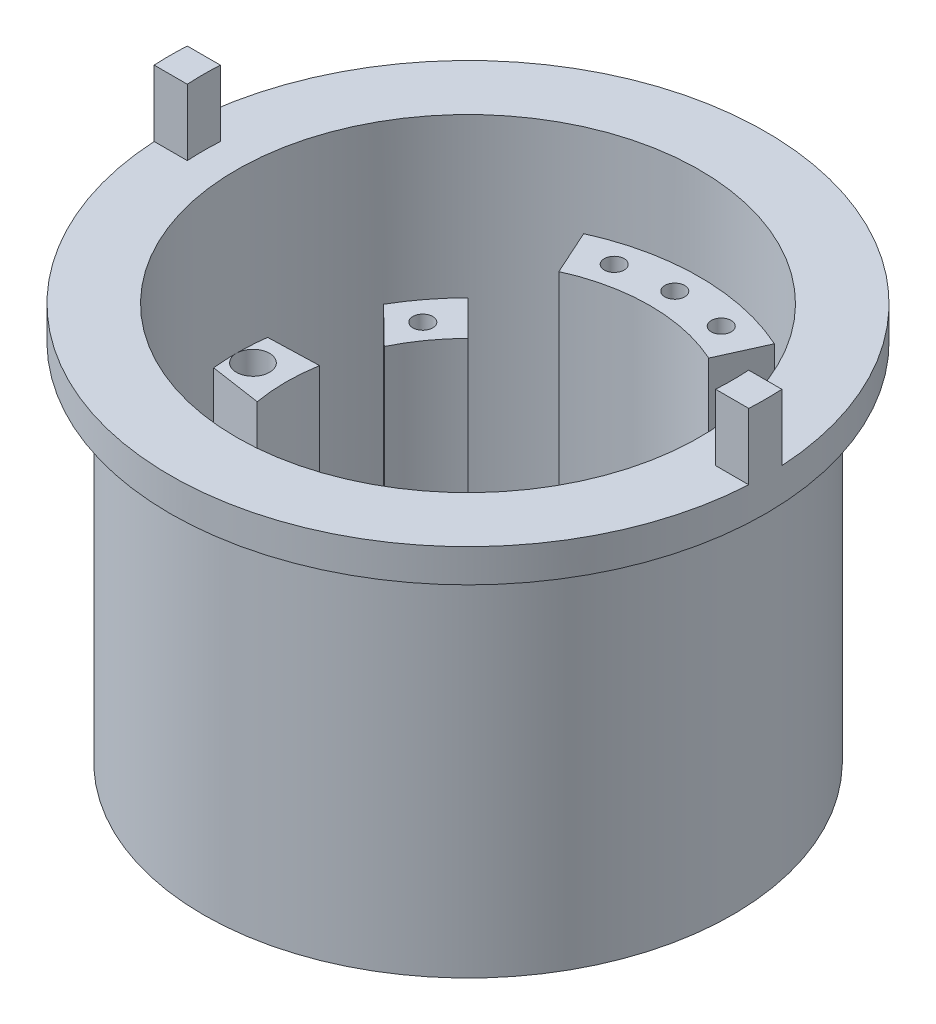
ISO-10303-21;
HEADER;
FILE_DESCRIPTION(('STEP AP214'),'2;1');
FILE_NAME('part.step','',(''),(''),'','','');
FILE_SCHEMA(('AUTOMOTIVE_DESIGN { 1 0 10303 214 1 1 1 1 }'));
ENDSEC;
DATA;
#1=APPLICATION_CONTEXT('core data for automotive mechanical design processes');
#2=APPLICATION_PROTOCOL_DEFINITION('international standard','automotive_design',2000,#1);
#3=PRODUCT_CONTEXT('',#1,'mechanical');
#4=PRODUCT('Part','Part','',(#3));
#5=PRODUCT_RELATED_PRODUCT_CATEGORY('part','',(#4));
#6=PRODUCT_DEFINITION_FORMATION('','',#4);
#7=PRODUCT_DEFINITION_CONTEXT('part definition',#1,'design');
#8=PRODUCT_DEFINITION('design','',#6,#7);
#9=PRODUCT_DEFINITION_SHAPE('','',#8);
#10=(LENGTH_UNIT() NAMED_UNIT(*) SI_UNIT(.MILLI.,.METRE.));
#11=(NAMED_UNIT(*) PLANE_ANGLE_UNIT() SI_UNIT($,.RADIAN.));
#12=(NAMED_UNIT(*) SI_UNIT($,.STERADIAN.) SOLID_ANGLE_UNIT());
#13=UNCERTAINTY_MEASURE_WITH_UNIT(LENGTH_MEASURE(1.E-05),#10,'distance_accuracy_value','');
#14=(GEOMETRIC_REPRESENTATION_CONTEXT(3) GLOBAL_UNCERTAINTY_ASSIGNED_CONTEXT((#13)) GLOBAL_UNIT_ASSIGNED_CONTEXT((#10,
#11,#12)) REPRESENTATION_CONTEXT('',''));
#15=CARTESIAN_POINT('',(0.,0.,0.));
#16=DIRECTION('',(0.,0.,1.));
#17=DIRECTION('',(1.,0.,0.));
#18=AXIS2_PLACEMENT_3D('',#15,#16,#17);
#19=CARTESIAN_POINT('',(0.,36.,0.));
#20=DIRECTION('',(0.,-1.,0.));
#21=DIRECTION('',(0.,0.,-1.));
#22=AXIS2_PLACEMENT_3D('',#19,#20,#21);
#23=CYLINDRICAL_SURFACE('',#22,27.5);
#24=CARTESIAN_POINT('',(0.,36.,0.));
#25=DIRECTION('',(0.,-1.,0.));
#26=DIRECTION('',(0.,0.,1.));
#27=AXIS2_PLACEMENT_3D('',#24,#25,#26);
#28=CIRCLE('',#27,27.5);
#29=CARTESIAN_POINT('',(24.714235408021,36.,12.0605376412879));
#30=VERTEX_POINT('',#29);
#31=CARTESIAN_POINT('',(19.4454364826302,36.,19.44543648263));
#32=VERTEX_POINT('',#31);
#33=EDGE_CURVE('E653',#30,#32,#28,.T.);
#34=ORIENTED_EDGE('',*,*,#33,.F.);
#35=DIRECTION('',(0.,1.,0.));
#36=VECTOR('',#35,1.);
#37=CARTESIAN_POINT('',(24.714235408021,5.,12.0605376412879));
#38=LINE('',#37,#36);
#39=CARTESIAN_POINT('',(24.714235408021,5.,12.0605376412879));
#40=VERTEX_POINT('',#39);
#41=EDGE_CURVE('E375',#40,#30,#38,.T.);
#42=ORIENTED_EDGE('',*,*,#41,.F.);
#43=CARTESIAN_POINT('',(0.,5.,0.));
#44=DIRECTION('',(0.,-1.,0.));
#45=DIRECTION('',(0.,0.,1.));
#46=AXIS2_PLACEMENT_3D('',#43,#44,#45);
#47=CIRCLE('',#46,27.5);
#48=CARTESIAN_POINT('',(19.4454364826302,5.,19.44543648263));
#49=VERTEX_POINT('',#48);
#50=EDGE_CURVE('E664',#40,#49,#47,.T.);
#51=ORIENTED_EDGE('',*,*,#50,.T.);
#52=DIRECTION('',(0.,-1.,0.));
#53=VECTOR('',#52,1.);
#54=CARTESIAN_POINT('',(19.4454364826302,36.,19.44543648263));
#55=LINE('',#54,#53);
#56=EDGE_CURVE('E673',#32,#49,#55,.T.);
#57=ORIENTED_EDGE('',*,*,#56,.F.);
#58=EDGE_LOOP('',(#34,#42,#51,#57));
#59=FACE_BOUND('',#58,.T.);
#60=ADVANCED_FACE('F32',(#59),#23,.F.);
#61=CARTESIAN_POINT('',(0.,36.,0.));
#62=DIRECTION('',(0.,1.,0.));
#63=DIRECTION('',(0.,0.,1.));
#64=AXIS2_PLACEMENT_3D('',#61,#62,#63);
#65=PLANE('',#64);
#66=DIRECTION('',(0.714502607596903,0.,0.699632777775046));
#67=VECTOR('',#66,1.);
#68=CARTESIAN_POINT('',(24.714235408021,36.,12.0605376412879));
#69=LINE('',#68,#67);
#70=CARTESIAN_POINT('',(30.2958617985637,36.,17.5260023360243));
#71=VERTEX_POINT('',#70);
#72=EDGE_CURVE('E48',#30,#71,#69,.T.);
#73=ORIENTED_EDGE('',*,*,#72,.F.);
#74=ORIENTED_EDGE('',*,*,#33,.T.);
#75=DIRECTION('',(0.707106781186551,0.,0.707106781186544));
#76=VECTOR('',#75,1.);
#77=CARTESIAN_POINT('',(19.4454364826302,36.,19.44543648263));
#78=LINE('',#77,#76);
#79=CARTESIAN_POINT('',(24.7487373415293,36.,24.748737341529));
#80=VERTEX_POINT('',#79);
#81=EDGE_CURVE('E657',#32,#80,#78,.T.);
#82=ORIENTED_EDGE('',*,*,#81,.T.);
#83=CARTESIAN_POINT('',(0.,36.,0.));
#84=DIRECTION('',(0.,1.,0.));
#85=DIRECTION('',(0.,0.,1.));
#86=AXIS2_PLACEMENT_3D('',#83,#84,#85);
#87=CIRCLE('',#86,35.);
#88=EDGE_CURVE('E647',#80,#71,#87,.T.);
#89=ORIENTED_EDGE('',*,*,#88,.T.);
#90=EDGE_LOOP('',(#73,#74,#82,#89));
#91=FACE_BOUND('',#90,.T.);
#92=CARTESIAN_POINT('',(24.9823308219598,36.,18.150725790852));
#93=DIRECTION('',(0.,1.,0.));
#94=DIRECTION('',(0.,0.,1.));
#95=AXIS2_PLACEMENT_3D('',#92,#93,#94);
#96=CIRCLE('',#95,1.49999999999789);
#97=CARTESIAN_POINT('',(24.9823308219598,36.,19.6507257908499));
#98=VERTEX_POINT('',#97);
#99=EDGE_CURVE('E554',#98,#98,#96,.T.);
#100=ORIENTED_EDGE('',*,*,#99,.F.);
#101=EDGE_LOOP('',(#100));
#102=FACE_BOUND('',#101,.T.);
#103=ADVANCED_FACE('F832',(#91,#102),#65,.T.);
#104=CARTESIAN_POINT('',(0.,36.,0.));
#105=DIRECTION('',(0.,-1.,0.));
#106=DIRECTION('',(0.,0.,-1.));
#107=AXIS2_PLACEMENT_3D('',#104,#105,#106);
#108=CYLINDRICAL_SURFACE('',#107,27.5);
#109=CARTESIAN_POINT('',(0.,36.,0.));
#110=DIRECTION('',(0.,-1.,0.));
#111=DIRECTION('',(0.,0.,1.));
#112=AXIS2_PLACEMENT_3D('',#109,#110,#111);
#113=CIRCLE('',#112,27.5);
#114=CARTESIAN_POINT('',(-27.0832426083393,36.,4.76948318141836));
#115=VERTEX_POINT('',#114);
#116=CARTESIAN_POINT('',(-27.1002765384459,36.,-4.67172468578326));
#117=VERTEX_POINT('',#116);
#118=EDGE_CURVE('E696',#115,#117,#113,.T.);
#119=ORIENTED_EDGE('',*,*,#118,.F.);
#120=DIRECTION('',(0.,1.,0.));
#121=VECTOR('',#120,1.);
#122=CARTESIAN_POINT('',(-27.0832426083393,5.,4.76948318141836));
#123=LINE('',#122,#121);
#124=CARTESIAN_POINT('',(-27.0832426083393,5.,4.76948318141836));
#125=VERTEX_POINT('',#124);
#126=EDGE_CURVE('E394',#125,#115,#123,.T.);
#127=ORIENTED_EDGE('',*,*,#126,.F.);
#128=CARTESIAN_POINT('',(0.,5.,0.));
#129=DIRECTION('',(0.,-1.,0.));
#130=DIRECTION('',(0.,0.,1.));
#131=AXIS2_PLACEMENT_3D('',#128,#129,#130);
#132=CIRCLE('',#131,27.5);
#133=CARTESIAN_POINT('',(-27.1002765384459,5.,-4.67172468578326));
#134=VERTEX_POINT('',#133);
#135=EDGE_CURVE('E707',#125,#134,#132,.T.);
#136=ORIENTED_EDGE('',*,*,#135,.T.);
#137=DIRECTION('',(0.,1.,0.));
#138=VECTOR('',#137,1.);
#139=CARTESIAN_POINT('',(-27.1002765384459,5.,-4.67172468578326));
#140=LINE('',#139,#138);
#141=EDGE_CURVE('E418',#134,#117,#140,.T.);
#142=ORIENTED_EDGE('',*,*,#141,.T.);
#143=EDGE_LOOP('',(#119,#127,#136,#142));
#144=FACE_BOUND('',#143,.T.);
#145=ADVANCED_FACE('F851',(#144),#108,.F.);
#146=CARTESIAN_POINT('',(-24.7142354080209,36.,-12.0605376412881));
#147=VERTEX_POINT('',#146);
#148=CARTESIAN_POINT('',(-19.4454364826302,36.,-19.44543648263));
#149=VERTEX_POINT('',#148);
#150=EDGE_CURVE('E691',#147,#149,#113,.T.);
#151=ORIENTED_EDGE('',*,*,#150,.F.);
#152=DIRECTION('',(0.,1.,0.));
#153=VECTOR('',#152,1.);
#154=CARTESIAN_POINT('',(-24.7142354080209,5.,-12.0605376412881));
#155=LINE('',#154,#153);
#156=CARTESIAN_POINT('',(-24.7142354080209,5.,-12.0605376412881));
#157=VERTEX_POINT('',#156);
#158=EDGE_CURVE('E416',#157,#147,#155,.T.);
#159=ORIENTED_EDGE('',*,*,#158,.F.);
#160=CARTESIAN_POINT('',(-19.4454364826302,5.,-19.44543648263));
#161=VERTEX_POINT('',#160);
#162=EDGE_CURVE('E702',#157,#161,#132,.T.);
#163=ORIENTED_EDGE('',*,*,#162,.T.);
#164=DIRECTION('',(0.,-1.,0.));
#165=VECTOR('',#164,1.);
#166=CARTESIAN_POINT('',(-19.4454364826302,36.,-19.44543648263));
#167=LINE('',#166,#165);
#168=EDGE_CURVE('E711',#149,#161,#167,.T.);
#169=ORIENTED_EDGE('',*,*,#168,.F.);
#170=EDGE_LOOP('',(#151,#159,#163,#169));
#171=FACE_BOUND('',#170,.T.);
#172=ADVANCED_FACE('F1172',(#171),#108,.F.);
#173=CARTESIAN_POINT('',(0.,36.,0.));
#174=DIRECTION('',(0.,1.,0.));
#175=DIRECTION('',(0.,0.,1.));
#176=AXIS2_PLACEMENT_3D('',#173,#174,#175);
#177=PLANE('',#176);
#178=DIRECTION('',(-0.989278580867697,0.,-0.146040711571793));
#179=VECTOR('',#178,1.);
#180=CARTESIAN_POINT('',(-27.0832426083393,36.,4.76948318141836));
#181=LINE('',#180,#179);
#182=CARTESIAN_POINT('',(-34.8113927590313,36.,3.62862703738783));
#183=VERTEX_POINT('',#182);
#184=EDGE_CURVE('E382',#115,#183,#181,.T.);
#185=ORIENTED_EDGE('',*,*,#184,.F.);
#186=ORIENTED_EDGE('',*,*,#118,.T.);
#187=DIRECTION('',(0.99951478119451,0.,-0.0311480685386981));
#188=VECTOR('',#187,1.);
#189=CARTESIAN_POINT('',(-27.1002765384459,36.,-4.67172468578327));
#190=LINE('',#189,#188);
#191=CARTESIAN_POINT('',(-34.7179591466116,36.,-4.43433339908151));
#192=VERTEX_POINT('',#191);
#193=EDGE_CURVE('E411',#192,#117,#190,.T.);
#194=ORIENTED_EDGE('',*,*,#193,.F.);
#195=CARTESIAN_POINT('',(0.,36.,0.));
#196=DIRECTION('',(0.,1.,0.));
#197=DIRECTION('',(0.,0.,1.));
#198=AXIS2_PLACEMENT_3D('',#195,#196,#197);
#199=CIRCLE('',#198,35.);
#200=CARTESIAN_POINT('',(-35.,36.,0.));
#201=VERTEX_POINT('',#200);
#202=EDGE_CURVE('E687',#192,#201,#199,.T.);
#203=ORIENTED_EDGE('',*,*,#202,.T.);
#204=CARTESIAN_POINT('',(-32.5,36.,0.));
#205=DIRECTION('',(0.,1.,0.));
#206=DIRECTION('',(0.,0.,1.));
#207=AXIS2_PLACEMENT_3D('',#204,#205,#206);
#208=CIRCLE('',#207,2.5);
#209=EDGE_CURVE('E640',#201,#201,#208,.T.);
#210=ORIENTED_EDGE('',*,*,#209,.F.);
#211=EDGE_CURVE('E689',#201,#183,#199,.T.);
#212=ORIENTED_EDGE('',*,*,#211,.T.);
#213=EDGE_LOOP('',(#185,#186,#194,#203,#210,#212));
#214=FACE_BOUND('',#213,.T.);
#215=ADVANCED_FACE('F1186',(#214),#177,.T.);
#216=DIRECTION('',(-0.714502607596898,0.,-0.699632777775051));
#217=VECTOR('',#216,1.);
#218=CARTESIAN_POINT('',(-24.7142354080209,36.,-12.0605376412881));
#219=LINE('',#218,#217);
#220=CARTESIAN_POINT('',(-30.2958617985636,36.,-17.5260023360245));
#221=VERTEX_POINT('',#220);
#222=EDGE_CURVE('E404',#147,#221,#219,.T.);
#223=ORIENTED_EDGE('',*,*,#222,.F.);
#224=ORIENTED_EDGE('',*,*,#150,.T.);
#225=DIRECTION('',(-0.707106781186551,0.,-0.707106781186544));
#226=VECTOR('',#225,1.);
#227=CARTESIAN_POINT('',(-19.4454364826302,36.,-19.44543648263));
#228=LINE('',#227,#226);
#229=CARTESIAN_POINT('',(-24.7487373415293,36.,-24.748737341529));
#230=VERTEX_POINT('',#229);
#231=EDGE_CURVE('E695',#149,#230,#228,.T.);
#232=ORIENTED_EDGE('',*,*,#231,.T.);
#233=EDGE_CURVE('E683',#230,#221,#199,.T.);
#234=ORIENTED_EDGE('',*,*,#233,.T.);
#235=EDGE_LOOP('',(#223,#224,#232,#234));
#236=FACE_BOUND('',#235,.T.);
#237=CARTESIAN_POINT('',(-24.9823308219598,36.,-18.1507257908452));
#238=DIRECTION('',(0.,1.,0.));
#239=DIRECTION('',(0.,0.,1.));
#240=AXIS2_PLACEMENT_3D('',#237,#238,#239);
#241=CIRCLE('',#240,1.50000000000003);
#242=CARTESIAN_POINT('',(-24.9823308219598,36.,-16.6507257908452));
#243=VERTEX_POINT('',#242);
#244=EDGE_CURVE('E566',#243,#243,#241,.T.);
#245=ORIENTED_EDGE('',*,*,#244,.F.);
#246=EDGE_LOOP('',(#245));
#247=FACE_BOUND('',#246,.T.);
#248=ADVANCED_FACE('F856',(#236,#247),#177,.T.);
#249=CARTESIAN_POINT('',(27.0832426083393,5.,-4.76948318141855));
#250=VERTEX_POINT('',#249);
#251=CARTESIAN_POINT('',(27.100276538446,5.,4.67172468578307));
#252=VERTEX_POINT('',#251);
#253=EDGE_CURVE('E669',#250,#252,#47,.T.);
#254=ORIENTED_EDGE('',*,*,#253,.T.);
#255=DIRECTION('',(0.,1.,0.));
#256=VECTOR('',#255,1.);
#257=CARTESIAN_POINT('',(27.100276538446,5.,4.67172468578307));
#258=LINE('',#257,#256);
#259=CARTESIAN_POINT('',(27.100276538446,36.,4.67172468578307));
#260=VERTEX_POINT('',#259);
#261=EDGE_CURVE('E352',#252,#260,#258,.T.);
#262=ORIENTED_EDGE('',*,*,#261,.T.);
#263=CARTESIAN_POINT('',(27.0832426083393,36.,-4.76948318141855));
#264=VERTEX_POINT('',#263);
#265=EDGE_CURVE('E658',#264,#260,#28,.T.);
#266=ORIENTED_EDGE('',*,*,#265,.F.);
#267=DIRECTION('',(0.,1.,0.));
#268=VECTOR('',#267,1.);
#269=CARTESIAN_POINT('',(27.0832426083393,5.,-4.76948318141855));
#270=LINE('',#269,#268);
#271=EDGE_CURVE('E439',#250,#264,#270,.T.);
#272=ORIENTED_EDGE('',*,*,#271,.F.);
#273=EDGE_LOOP('',(#254,#262,#266,#272));
#274=FACE_BOUND('',#273,.T.);
#275=ADVANCED_FACE('F820',(#274),#23,.F.);
#276=DIRECTION('',(-0.999514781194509,0.,0.0311480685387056));
#277=VECTOR('',#276,1.);
#278=CARTESIAN_POINT('',(27.100276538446,36.,4.67172468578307));
#279=LINE('',#278,#277);
#280=CARTESIAN_POINT('',(34.7179591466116,36.,4.43433339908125));
#281=VERTEX_POINT('',#280);
#282=EDGE_CURVE('E366',#281,#260,#279,.T.);
#283=ORIENTED_EDGE('',*,*,#282,.F.);
#284=CARTESIAN_POINT('',(34.8113927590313,36.,-3.62862703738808));
#285=VERTEX_POINT('',#284);
#286=EDGE_CURVE('E349',#281,#285,#87,.T.);
#287=ORIENTED_EDGE('',*,*,#286,.T.);
#288=DIRECTION('',(0.989278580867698,0.,0.146040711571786));
#289=VECTOR('',#288,1.);
#290=CARTESIAN_POINT('',(27.0832426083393,36.,-4.76948318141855));
#291=LINE('',#290,#289);
#292=EDGE_CURVE('E426',#264,#285,#291,.T.);
#293=ORIENTED_EDGE('',*,*,#292,.F.);
#294=ORIENTED_EDGE('',*,*,#265,.T.);
#295=EDGE_LOOP('',(#283,#287,#293,#294));
#296=FACE_BOUND('',#295,.T.);
#297=CARTESIAN_POINT('',(30.879859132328,36.,0.));
#298=DIRECTION('',(0.,1.,0.));
#299=DIRECTION('',(0.,0.,1.));
#300=AXIS2_PLACEMENT_3D('',#297,#298,#299);
#301=CIRCLE('',#300,1.5);
#302=CARTESIAN_POINT('',(30.879859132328,36.,1.49999999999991));
#303=VERTEX_POINT('',#302);
#304=EDGE_CURVE('E553',#303,#303,#301,.T.);
#305=ORIENTED_EDGE('',*,*,#304,.F.);
#306=EDGE_LOOP('',(#305));
#307=FACE_BOUND('',#306,.T.);
#308=ADVANCED_FACE('F811',(#296,#307),#65,.T.);
#309=CARTESIAN_POINT('',(0.,60.,0.));
#310=DIRECTION('',(0.,1.,0.));
#311=DIRECTION('',(0.,0.,1.));
#312=AXIS2_PLACEMENT_3D('',#309,#310,#311);
#313=PLANE('',#312);
#314=CARTESIAN_POINT('',(0.,60.,0.));
#315=DIRECTION('',(0.,1.,0.));
#316=DIRECTION('',(0.,0.,1.));
#317=AXIS2_PLACEMENT_3D('',#314,#315,#316);
#318=CIRCLE('',#317,35.);
#319=CARTESIAN_POINT('',(0.,60.,35.));
#320=VERTEX_POINT('',#319);
#321=EDGE_CURVE('E504',#320,#320,#318,.T.);
#322=ORIENTED_EDGE('',*,*,#321,.F.);
#323=EDGE_LOOP('',(#322));
#324=FACE_BOUND('',#323,.T.);
#325=CARTESIAN_POINT('',(0.,60.,0.));
#326=DIRECTION('',(0.,-1.,0.));
#327=DIRECTION('',(0.,0.,1.));
#328=AXIS2_PLACEMENT_3D('',#325,#326,#327);
#329=CIRCLE('',#328,40.);
#330=CARTESIAN_POINT('',(-39.9217985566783,60.,2.5));
#331=VERTEX_POINT('',#330);
#332=CARTESIAN_POINT('',(-39.9217985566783,60.,-2.5));
#333=VERTEX_POINT('',#332);
#334=EDGE_CURVE('E458',#331,#333,#329,.T.);
#335=ORIENTED_EDGE('',*,*,#334,.F.);
#336=DIRECTION('',(1.,0.,0.));
#337=VECTOR('',#336,1.);
#338=CARTESIAN_POINT('',(-44.9305018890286,60.,2.5));
#339=LINE('',#338,#337);
#340=CARTESIAN_POINT('',(-44.9305018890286,60.,2.5));
#341=VERTEX_POINT('',#340);
#342=EDGE_CURVE('E438',#341,#331,#339,.T.);
#343=ORIENTED_EDGE('',*,*,#342,.F.);
#344=CARTESIAN_POINT('',(0.,60.,0.));
#345=DIRECTION('',(0.,1.,0.));
#346=DIRECTION('',(0.,0.,1.));
#347=AXIS2_PLACEMENT_3D('',#344,#345,#346);
#348=CIRCLE('',#347,45.);
#349=CARTESIAN_POINT('',(44.9305018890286,60.,2.5));
#350=VERTEX_POINT('',#349);
#351=EDGE_CURVE('E511',#341,#350,#348,.T.);
#352=ORIENTED_EDGE('',*,*,#351,.T.);
#353=DIRECTION('',(1.,0.,0.));
#354=VECTOR('',#353,1.);
#355=CARTESIAN_POINT('',(39.9217985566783,60.,2.5));
#356=LINE('',#355,#354);
#357=CARTESIAN_POINT('',(39.9217985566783,60.,2.5));
#358=VERTEX_POINT('',#357);
#359=EDGE_CURVE('E488',#358,#350,#356,.T.);
#360=ORIENTED_EDGE('',*,*,#359,.F.);
#361=CARTESIAN_POINT('',(0.,60.,0.));
#362=DIRECTION('',(0.,-1.,0.));
#363=DIRECTION('',(0.,0.,1.));
#364=AXIS2_PLACEMENT_3D('',#361,#362,#363);
#365=CIRCLE('',#364,40.);
#366=CARTESIAN_POINT('',(39.9217985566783,60.,-2.5));
#367=VERTEX_POINT('',#366);
#368=EDGE_CURVE('E474',#367,#358,#365,.T.);
#369=ORIENTED_EDGE('',*,*,#368,.F.);
#370=DIRECTION('',(-1.,0.,0.));
#371=VECTOR('',#370,1.);
#372=CARTESIAN_POINT('',(39.9217985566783,60.,-2.5));
#373=LINE('',#372,#371);
#374=CARTESIAN_POINT('',(44.9305018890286,60.,-2.5));
#375=VERTEX_POINT('',#374);
#376=EDGE_CURVE('E479',#375,#367,#373,.T.);
#377=ORIENTED_EDGE('',*,*,#376,.F.);
#378=CARTESIAN_POINT('',(-44.9305018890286,60.,-2.5));
#379=VERTEX_POINT('',#378);
#380=EDGE_CURVE('E508',#375,#379,#348,.T.);
#381=ORIENTED_EDGE('',*,*,#380,.T.);
#382=DIRECTION('',(-1.,0.,0.));
#383=VECTOR('',#382,1.);
#384=CARTESIAN_POINT('',(-44.9305018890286,60.,-2.5));
#385=LINE('',#384,#383);
#386=EDGE_CURVE('E449',#333,#379,#385,.T.);
#387=ORIENTED_EDGE('',*,*,#386,.F.);
#388=EDGE_LOOP('',(#335,#343,#352,#360,#369,#377,#381,#387));
#389=FACE_BOUND('',#388,.T.);
#390=ADVANCED_FACE('F913',(#324,#389),#313,.T.);
#391=CARTESIAN_POINT('',(0.,5.,0.));
#392=DIRECTION('',(0.,1.,0.));
#393=DIRECTION('',(0.,0.,1.));
#394=AXIS2_PLACEMENT_3D('',#391,#392,#393);
#395=PLANE('',#394);
#396=DIRECTION('',(0.382683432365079,0.,-0.923879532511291));
#397=VECTOR('',#396,1.);
#398=CARTESIAN_POINT('',(7.11791184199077,5.,7.11791184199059));
#399=LINE('',#398,#397);
#400=CARTESIAN_POINT('',(7.11791184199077,5.,7.11791184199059));
#401=VERTEX_POINT('',#400);
#402=CARTESIAN_POINT('',(10.0662474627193,5.,0.));
#403=VERTEX_POINT('',#402);
#404=EDGE_CURVE('E723',#401,#403,#399,.T.);
#405=ORIENTED_EDGE('',*,*,#404,.F.);
#406=DIRECTION('',(0.923879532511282,0.,-0.382683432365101));
#407=VECTOR('',#406,1.);
#408=CARTESIAN_POINT('',(1.08690532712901E-13,5.,10.0662474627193));
#409=LINE('',#408,#407);
#410=CARTESIAN_POINT('',(1.08690532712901E-13,5.,10.0662474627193));
#411=VERTEX_POINT('',#410);
#412=EDGE_CURVE('E728',#411,#401,#409,.T.);
#413=ORIENTED_EDGE('',*,*,#412,.F.);
#414=DIRECTION('',(0.923879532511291,0.,0.38268343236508));
#415=VECTOR('',#414,1.);
#416=CARTESIAN_POINT('',(-7.11791184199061,5.,7.11791184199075));
#417=LINE('',#416,#415);
#418=CARTESIAN_POINT('',(-7.11791184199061,5.,7.11791184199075));
#419=VERTEX_POINT('',#418);
#420=EDGE_CURVE('E766',#419,#411,#417,.T.);
#421=ORIENTED_EDGE('',*,*,#420,.F.);
#422=DIRECTION('',(0.382683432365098,0.,0.923879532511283));
#423=VECTOR('',#422,1.);
#424=CARTESIAN_POINT('',(-10.0662474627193,5.,1.02348685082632E-13));
#425=LINE('',#424,#423);
#426=CARTESIAN_POINT('',(-10.0662474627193,5.,1.02348685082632E-13));
#427=VERTEX_POINT('',#426);
#428=EDGE_CURVE('E763',#427,#419,#425,.T.);
#429=ORIENTED_EDGE('',*,*,#428,.F.);
#430=DIRECTION('',(-0.38268343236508,0.,0.923879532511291));
#431=VECTOR('',#430,1.);
#432=CARTESIAN_POINT('',(-7.11791184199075,5.,-7.1179118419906));
#433=LINE('',#432,#431);
#434=CARTESIAN_POINT('',(-7.11791184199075,5.,-7.1179118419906));
#435=VERTEX_POINT('',#434);
#436=EDGE_CURVE('E760',#435,#427,#433,.T.);
#437=ORIENTED_EDGE('',*,*,#436,.F.);
#438=DIRECTION('',(-0.923879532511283,0.,0.382683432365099));
#439=VECTOR('',#438,1.);
#440=CARTESIAN_POINT('',(-1.0321604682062E-13,5.,-10.0662474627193));
#441=LINE('',#440,#439);
#442=CARTESIAN_POINT('',(-1.0321604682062E-13,5.,-10.0662474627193));
#443=VERTEX_POINT('',#442);
#444=EDGE_CURVE('E757',#443,#435,#441,.T.);
#445=ORIENTED_EDGE('',*,*,#444,.F.);
#446=DIRECTION('',(-0.923879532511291,0.,-0.38268343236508));
#447=VECTOR('',#446,1.);
#448=CARTESIAN_POINT('',(7.1179118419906,5.,-7.11791184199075));
#449=LINE('',#448,#447);
#450=CARTESIAN_POINT('',(7.1179118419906,5.,-7.11791184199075));
#451=VERTEX_POINT('',#450);
#452=EDGE_CURVE('E754',#451,#443,#449,.T.);
#453=ORIENTED_EDGE('',*,*,#452,.F.);
#454=DIRECTION('',(-0.3826834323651,0.,-0.923879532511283));
#455=VECTOR('',#454,1.);
#456=CARTESIAN_POINT('',(10.0662474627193,5.,0.));
#457=LINE('',#456,#455);
#458=EDGE_CURVE('E751',#403,#451,#457,.T.);
#459=ORIENTED_EDGE('',*,*,#458,.F.);
#460=EDGE_LOOP('',(#405,#413,#421,#429,#437,#445,#453,#459));
#461=FACE_BOUND('',#460,.T.);
#462=CARTESIAN_POINT('',(0.,5.,0.));
#463=DIRECTION('',(0.,-1.,0.));
#464=DIRECTION('',(0.,0.,1.));
#465=AXIS2_PLACEMENT_3D('',#462,#463,#464);
#466=CIRCLE('',#465,27.5);
#467=CARTESIAN_POINT('',(-11.3225113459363,5.,-25.0609404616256));
#468=VERTEX_POINT('',#467);
#469=CARTESIAN_POINT('',(11.3225113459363,5.,-25.0609404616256));
#470=VERTEX_POINT('',#469);
#471=EDGE_CURVE('E594',#468,#470,#466,.T.);
#472=ORIENTED_EDGE('',*,*,#471,.F.);
#473=DIRECTION('',(0.411727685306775,0.,0.911306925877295));
#474=VECTOR('',#473,1.);
#475=CARTESIAN_POINT('',(-14.4104689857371,5.,-31.8957424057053));
#476=LINE('',#475,#474);
#477=CARTESIAN_POINT('',(-14.4104689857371,5.,-31.8957424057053));
#478=VERTEX_POINT('',#477);
#479=EDGE_CURVE('E577',#478,#468,#476,.T.);
#480=ORIENTED_EDGE('',*,*,#479,.F.);
#481=CARTESIAN_POINT('',(0.,5.,0.));
#482=DIRECTION('',(0.,1.,0.));
#483=DIRECTION('',(0.,0.,1.));
#484=AXIS2_PLACEMENT_3D('',#481,#482,#483);
#485=CIRCLE('',#484,35.);
#486=CARTESIAN_POINT('',(-24.7487373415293,5.,-24.748737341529));
#487=VERTEX_POINT('',#486);
#488=EDGE_CURVE('E11',#487,#478,#485,.F.);
#489=ORIENTED_EDGE('',*,*,#488,.F.);
#490=DIRECTION('',(-0.707106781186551,0.,-0.707106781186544));
#491=VECTOR('',#490,1.);
#492=CARTESIAN_POINT('',(-19.4454364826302,5.,-19.44543648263));
#493=LINE('',#492,#491);
#494=EDGE_CURVE('E706',#161,#487,#493,.T.);
#495=ORIENTED_EDGE('',*,*,#494,.F.);
#496=ORIENTED_EDGE('',*,*,#162,.F.);
#497=DIRECTION('',(-0.714502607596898,0.,-0.699632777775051));
#498=VECTOR('',#497,1.);
#499=CARTESIAN_POINT('',(-24.7142354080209,5.,-12.0605376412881));
#500=LINE('',#499,#498);
#501=CARTESIAN_POINT('',(-30.2958617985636,5.,-17.5260023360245));
#502=VERTEX_POINT('',#501);
#503=EDGE_CURVE('E407',#157,#502,#500,.T.);
#504=ORIENTED_EDGE('',*,*,#503,.T.);
#505=CARTESIAN_POINT('',(0.,5.,0.));
#506=DIRECTION('',(0.,1.,0.));
#507=DIRECTION('',(0.,0.,1.));
#508=AXIS2_PLACEMENT_3D('',#505,#506,#507);
#509=CIRCLE('',#508,35.);
#510=CARTESIAN_POINT('',(-34.7179591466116,5.,-4.43433339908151));
#511=VERTEX_POINT('',#510);
#512=EDGE_CURVE('E400',#502,#511,#509,.T.);
#513=ORIENTED_EDGE('',*,*,#512,.T.);
#514=DIRECTION('',(0.99951478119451,0.,-0.0311480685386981));
#515=VECTOR('',#514,1.);
#516=CARTESIAN_POINT('',(-27.1002765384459,5.,-4.67172468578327));
#517=LINE('',#516,#515);
#518=EDGE_CURVE('E403',#511,#134,#517,.T.);
#519=ORIENTED_EDGE('',*,*,#518,.T.);
#520=ORIENTED_EDGE('',*,*,#135,.F.);
#521=DIRECTION('',(-0.989278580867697,0.,-0.146040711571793));
#522=VECTOR('',#521,1.);
#523=CARTESIAN_POINT('',(-27.0832426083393,5.,4.76948318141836));
#524=LINE('',#523,#522);
#525=CARTESIAN_POINT('',(-34.8113927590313,5.,3.62862703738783));
#526=VERTEX_POINT('',#525);
#527=EDGE_CURVE('E385',#125,#526,#524,.T.);
#528=ORIENTED_EDGE('',*,*,#527,.T.);
#529=CARTESIAN_POINT('',(0.,5.,0.));
#530=DIRECTION('',(0.,1.,0.));
#531=DIRECTION('',(0.,0.,1.));
#532=AXIS2_PLACEMENT_3D('',#529,#530,#531);
#533=CIRCLE('',#532,35.);
#534=CARTESIAN_POINT('',(-30.693854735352,5.,16.8192532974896));
#535=VERTEX_POINT('',#534);
#536=EDGE_CURVE('E378',#526,#535,#533,.T.);
#537=ORIENTED_EDGE('',*,*,#536,.T.);
#538=DIRECTION('',(0.790316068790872,0.,-0.612699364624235));
#539=VECTOR('',#538,1.);
#540=CARTESIAN_POINT('',(-24.6705551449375,5.,12.1496382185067));
#541=LINE('',#540,#539);
#542=CARTESIAN_POINT('',(-24.6705551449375,5.,12.1496382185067));
#543=VERTEX_POINT('',#542);
#544=EDGE_CURVE('E381',#535,#543,#541,.T.);
#545=ORIENTED_EDGE('',*,*,#544,.T.);
#546=CARTESIAN_POINT('',(-19.4454364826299,5.,19.4454364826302));
#547=VERTEX_POINT('',#546);
#548=EDGE_CURVE('E703',#547,#543,#132,.T.);
#549=ORIENTED_EDGE('',*,*,#548,.F.);
#550=DIRECTION('',(0.707106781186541,0.,-0.707106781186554));
#551=VECTOR('',#550,1.);
#552=CARTESIAN_POINT('',(-19.4454364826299,5.,19.4454364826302));
#553=LINE('',#552,#551);
#554=CARTESIAN_POINT('',(-24.748737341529,5.,24.7487373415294));
#555=VERTEX_POINT('',#554);
#556=EDGE_CURVE('E682',#555,#547,#553,.T.);
#557=ORIENTED_EDGE('',*,*,#556,.F.);
#558=CARTESIAN_POINT('',(-14.4104689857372,5.,31.8957424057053));
#559=VERTEX_POINT('',#558);
#560=EDGE_CURVE('E788',#559,#555,#485,.F.);
#561=ORIENTED_EDGE('',*,*,#560,.F.);
#562=DIRECTION('',(-0.411727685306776,0.,0.911306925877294));
#563=VECTOR('',#562,1.);
#564=CARTESIAN_POINT('',(-11.3225113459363,5.,25.0609404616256));
#565=LINE('',#564,#563);
#566=CARTESIAN_POINT('',(-11.3225113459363,5.,25.0609404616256));
#567=VERTEX_POINT('',#566);
#568=EDGE_CURVE('E625',#567,#559,#565,.T.);
#569=ORIENTED_EDGE('',*,*,#568,.F.);
#570=CARTESIAN_POINT('',(0.,5.,0.));
#571=DIRECTION('',(0.,-1.,0.));
#572=DIRECTION('',(0.,0.,1.));
#573=AXIS2_PLACEMENT_3D('',#570,#571,#572);
#574=CIRCLE('',#573,27.5);
#575=CARTESIAN_POINT('',(11.3225113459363,5.,25.0609404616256));
#576=VERTEX_POINT('',#575);
#577=EDGE_CURVE('E609',#576,#567,#574,.T.);
#578=ORIENTED_EDGE('',*,*,#577,.F.);
#579=DIRECTION('',(-0.411727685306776,0.,-0.911306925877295));
#580=VECTOR('',#579,1.);
#581=CARTESIAN_POINT('',(11.3225113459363,5.,25.0609404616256));
#582=LINE('',#581,#580);
#583=CARTESIAN_POINT('',(14.4104689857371,5.,31.8957424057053));
#584=VERTEX_POINT('',#583);
#585=EDGE_CURVE('E614',#584,#576,#582,.T.);
#586=ORIENTED_EDGE('',*,*,#585,.F.);
#587=CARTESIAN_POINT('',(24.7487373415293,5.,24.748737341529));
#588=VERTEX_POINT('',#587);
#589=EDGE_CURVE('E41',#588,#584,#485,.F.);
#590=ORIENTED_EDGE('',*,*,#589,.F.);
#591=DIRECTION('',(0.707106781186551,0.,0.707106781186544));
#592=VECTOR('',#591,1.);
#593=CARTESIAN_POINT('',(19.4454364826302,5.,19.44543648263));
#594=LINE('',#593,#592);
#595=EDGE_CURVE('E668',#49,#588,#594,.T.);
#596=ORIENTED_EDGE('',*,*,#595,.F.);
#597=ORIENTED_EDGE('',*,*,#50,.F.);
#598=DIRECTION('',(0.714502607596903,0.,0.699632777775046));
#599=VECTOR('',#598,1.);
#600=CARTESIAN_POINT('',(24.714235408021,5.,12.0605376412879));
#601=LINE('',#600,#599);
#602=CARTESIAN_POINT('',(30.2958617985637,5.,17.5260023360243));
#603=VERTEX_POINT('',#602);
#604=EDGE_CURVE('E353',#40,#603,#601,.T.);
#605=ORIENTED_EDGE('',*,*,#604,.T.);
#606=CARTESIAN_POINT('',(0.,5.,0.));
#607=DIRECTION('',(0.,1.,0.));
#608=DIRECTION('',(0.,0.,1.));
#609=AXIS2_PLACEMENT_3D('',#606,#607,#608);
#610=CIRCLE('',#609,35.);
#611=CARTESIAN_POINT('',(34.7179591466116,5.,4.43433339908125));
#612=VERTEX_POINT('',#611);
#613=EDGE_CURVE('E346',#603,#612,#610,.T.);
#614=ORIENTED_EDGE('',*,*,#613,.T.);
#615=DIRECTION('',(-0.999514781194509,0.,0.0311480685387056));
#616=VECTOR('',#615,1.);
#617=CARTESIAN_POINT('',(27.100276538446,5.,4.67172468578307));
#618=LINE('',#617,#616);
#619=EDGE_CURVE('E356',#612,#252,#618,.T.);
#620=ORIENTED_EDGE('',*,*,#619,.T.);
#621=ORIENTED_EDGE('',*,*,#253,.F.);
#622=DIRECTION('',(0.989278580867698,0.,0.146040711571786));
#623=VECTOR('',#622,1.);
#624=CARTESIAN_POINT('',(27.0832426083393,5.,-4.76948318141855));
#625=LINE('',#624,#623);
#626=CARTESIAN_POINT('',(34.8113927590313,5.,-3.62862703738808));
#627=VERTEX_POINT('',#626);
#628=EDGE_CURVE('E429',#250,#627,#625,.T.);
#629=ORIENTED_EDGE('',*,*,#628,.T.);
#630=CARTESIAN_POINT('',(0.,5.,0.));
#631=DIRECTION('',(0.,1.,0.));
#632=DIRECTION('',(0.,0.,1.));
#633=AXIS2_PLACEMENT_3D('',#630,#631,#632);
#634=CIRCLE('',#633,35.);
#635=CARTESIAN_POINT('',(30.6938547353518,5.,-16.8192532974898));
#636=VERTEX_POINT('',#635);
#637=EDGE_CURVE('E422',#627,#636,#634,.T.);
#638=ORIENTED_EDGE('',*,*,#637,.T.);
#639=DIRECTION('',(-0.790316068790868,0.,0.612699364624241));
#640=VECTOR('',#639,1.);
#641=CARTESIAN_POINT('',(24.6705551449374,5.,-12.1496382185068));
#642=LINE('',#641,#640);
#643=CARTESIAN_POINT('',(24.6705551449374,5.,-12.1496382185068));
#644=VERTEX_POINT('',#643);
#645=EDGE_CURVE('E425',#636,#644,#642,.T.);
#646=ORIENTED_EDGE('',*,*,#645,.T.);
#647=CARTESIAN_POINT('',(19.44543648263,5.,-19.4454364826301));
#648=VERTEX_POINT('',#647);
#649=EDGE_CURVE('E665',#648,#644,#47,.T.);
#650=ORIENTED_EDGE('',*,*,#649,.F.);
#651=DIRECTION('',(-0.707106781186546,0.,0.707106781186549));
#652=VECTOR('',#651,1.);
#653=CARTESIAN_POINT('',(19.44543648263,5.,-19.4454364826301));
#654=LINE('',#653,#652);
#655=CARTESIAN_POINT('',(24.7487373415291,5.,-24.7487373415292));
#656=VERTEX_POINT('',#655);
#657=EDGE_CURVE('E644',#656,#648,#654,.T.);
#658=ORIENTED_EDGE('',*,*,#657,.F.);
#659=CARTESIAN_POINT('',(14.4104689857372,5.,-31.8957424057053));
#660=VERTEX_POINT('',#659);
#661=EDGE_CURVE('E40',#660,#656,#485,.F.);
#662=ORIENTED_EDGE('',*,*,#661,.F.);
#663=DIRECTION('',(0.411727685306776,0.,-0.911306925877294));
#664=VECTOR('',#663,1.);
#665=CARTESIAN_POINT('',(14.4104689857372,5.,-31.8957424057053));
#666=LINE('',#665,#664);
#667=EDGE_CURVE('E584',#470,#660,#666,.T.);
#668=ORIENTED_EDGE('',*,*,#667,.F.);
#669=EDGE_LOOP('',(#472,#480,#489,#495,#496,#504,#513,#519,#520,#528,#537,#545,#549,#557,#561,
#569,#578,#586,#590,#596,#597,#605,#614,#620,#621,#629,#638,#646,#650,#658,#662,#668));
#670=FACE_BOUND('',#669,.T.);
#671=ADVANCED_FACE('F363',(#461,#670),#395,.T.);
#672=CARTESIAN_POINT('',(0.,55.,0.));
#673=DIRECTION('',(0.,-1.,0.));
#674=DIRECTION('',(0.,0.,-1.));
#675=AXIS2_PLACEMENT_3D('',#672,#673,#674);
#676=CYLINDRICAL_SURFACE('',#675,35.);
#677=ORIENTED_EDGE('',*,*,#488,.T.);
#678=DIRECTION('',(0.,-1.,0.));
#679=VECTOR('',#678,1.);
#680=CARTESIAN_POINT('',(-14.4104689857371,46.,-31.8957424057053));
#681=LINE('',#680,#679);
#682=CARTESIAN_POINT('',(-14.4104689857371,46.,-31.8957424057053));
#683=VERTEX_POINT('',#682);
#684=EDGE_CURVE('E606',#683,#478,#681,.T.);
#685=ORIENTED_EDGE('',*,*,#684,.F.);
#686=CARTESIAN_POINT('',(0.,46.,0.));
#687=DIRECTION('',(0.,1.,0.));
#688=DIRECTION('',(0.,0.,1.));
#689=AXIS2_PLACEMENT_3D('',#686,#687,#688);
#690=CIRCLE('',#689,35.);
#691=CARTESIAN_POINT('',(14.4104689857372,46.,-31.8957424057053));
#692=VERTEX_POINT('',#691);
#693=EDGE_CURVE('E580',#692,#683,#690,.T.);
#694=ORIENTED_EDGE('',*,*,#693,.F.);
#695=DIRECTION('',(0.,-1.,0.));
#696=VECTOR('',#695,1.);
#697=CARTESIAN_POINT('',(14.4104689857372,46.,-31.8957424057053));
#698=LINE('',#697,#696);
#699=EDGE_CURVE('E591',#692,#660,#698,.T.);
#700=ORIENTED_EDGE('',*,*,#699,.T.);
#701=ORIENTED_EDGE('',*,*,#661,.T.);
#702=DIRECTION('',(0.,-1.,0.));
#703=VECTOR('',#702,1.);
#704=CARTESIAN_POINT('',(24.7487373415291,36.,-24.7487373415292));
#705=LINE('',#704,#703);
#706=CARTESIAN_POINT('',(24.7487373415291,36.,-24.7487373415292));
#707=VERTEX_POINT('',#706);
#708=EDGE_CURVE('E679',#707,#656,#705,.T.);
#709=ORIENTED_EDGE('',*,*,#708,.F.);
#710=CARTESIAN_POINT('',(30.6938547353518,36.,-16.8192532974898));
#711=VERTEX_POINT('',#710);
#712=EDGE_CURVE('E651',#711,#707,#87,.T.);
#713=ORIENTED_EDGE('',*,*,#712,.F.);
#714=DIRECTION('',(0.,1.,0.));
#715=VECTOR('',#714,1.);
#716=CARTESIAN_POINT('',(30.6938547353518,5.,-16.8192532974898));
#717=LINE('',#716,#715);
#718=EDGE_CURVE('E432',#636,#711,#717,.T.);
#719=ORIENTED_EDGE('',*,*,#718,.F.);
#720=ORIENTED_EDGE('',*,*,#637,.F.);
#721=DIRECTION('',(0.,1.,0.));
#722=VECTOR('',#721,1.);
#723=CARTESIAN_POINT('',(34.8113927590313,5.,-3.62862703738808));
#724=LINE('',#723,#722);
#725=EDGE_CURVE('E436',#627,#285,#724,.T.);
#726=ORIENTED_EDGE('',*,*,#725,.T.);
#727=ORIENTED_EDGE('',*,*,#286,.F.);
#728=DIRECTION('',(0.,1.,0.));
#729=VECTOR('',#728,1.);
#730=CARTESIAN_POINT('',(34.7179591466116,5.,4.43433339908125));
#731=LINE('',#730,#729);
#732=EDGE_CURVE('E341',#612,#281,#731,.T.);
#733=ORIENTED_EDGE('',*,*,#732,.F.);
#734=ORIENTED_EDGE('',*,*,#613,.F.);
#735=DIRECTION('',(0.,1.,0.));
#736=VECTOR('',#735,1.);
#737=CARTESIAN_POINT('',(30.2958617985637,5.,17.5260023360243));
#738=LINE('',#737,#736);
#739=EDGE_CURVE('E372',#603,#71,#738,.T.);
#740=ORIENTED_EDGE('',*,*,#739,.T.);
#741=ORIENTED_EDGE('',*,*,#88,.F.);
#742=DIRECTION('',(0.,-1.,0.));
#743=VECTOR('',#742,1.);
#744=CARTESIAN_POINT('',(24.7487373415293,36.,24.748737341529));
#745=LINE('',#744,#743);
#746=EDGE_CURVE('E661',#80,#588,#745,.T.);
#747=ORIENTED_EDGE('',*,*,#746,.T.);
#748=ORIENTED_EDGE('',*,*,#589,.T.);
#749=DIRECTION('',(0.,-1.,0.));
#750=VECTOR('',#749,1.);
#751=CARTESIAN_POINT('',(14.4104689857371,46.,31.8957424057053));
#752=LINE('',#751,#750);
#753=CARTESIAN_POINT('',(14.4104689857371,46.,31.8957424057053));
#754=VERTEX_POINT('',#753);
#755=EDGE_CURVE('E632',#754,#584,#752,.T.);
#756=ORIENTED_EDGE('',*,*,#755,.F.);
#757=CARTESIAN_POINT('',(0.,46.,0.));
#758=DIRECTION('',(0.,1.,0.));
#759=DIRECTION('',(0.,0.,1.));
#760=AXIS2_PLACEMENT_3D('',#757,#758,#759);
#761=CIRCLE('',#760,35.);
#762=CARTESIAN_POINT('',(-14.4104689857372,46.,31.8957424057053));
#763=VERTEX_POINT('',#762);
#764=EDGE_CURVE('E617',#763,#754,#761,.T.);
#765=ORIENTED_EDGE('',*,*,#764,.F.);
#766=DIRECTION('',(0.,-1.,0.));
#767=VECTOR('',#766,1.);
#768=CARTESIAN_POINT('',(-14.4104689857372,46.,31.8957424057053));
#769=LINE('',#768,#767);
#770=EDGE_CURVE('E635',#763,#559,#769,.T.);
#771=ORIENTED_EDGE('',*,*,#770,.T.);
#772=ORIENTED_EDGE('',*,*,#560,.T.);
#773=DIRECTION('',(0.,-1.,0.));
#774=VECTOR('',#773,1.);
#775=CARTESIAN_POINT('',(-24.748737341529,36.,24.7487373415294));
#776=LINE('',#775,#774);
#777=CARTESIAN_POINT('',(-24.748737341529,36.,24.7487373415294));
#778=VERTEX_POINT('',#777);
#779=EDGE_CURVE('E717',#778,#555,#776,.T.);
#780=ORIENTED_EDGE('',*,*,#779,.F.);
#781=CARTESIAN_POINT('',(-30.693854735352,36.,16.8192532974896));
#782=VERTEX_POINT('',#781);
#783=EDGE_CURVE('E688',#782,#778,#199,.T.);
#784=ORIENTED_EDGE('',*,*,#783,.F.);
#785=DIRECTION('',(0.,1.,0.));
#786=VECTOR('',#785,1.);
#787=CARTESIAN_POINT('',(-30.693854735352,5.,16.8192532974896));
#788=LINE('',#787,#786);
#789=EDGE_CURVE('E56',#535,#782,#788,.T.);
#790=ORIENTED_EDGE('',*,*,#789,.F.);
#791=ORIENTED_EDGE('',*,*,#536,.F.);
#792=DIRECTION('',(0.,1.,0.));
#793=VECTOR('',#792,1.);
#794=CARTESIAN_POINT('',(-34.8113927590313,5.,3.62862703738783));
#795=LINE('',#794,#793);
#796=EDGE_CURVE('E370',#526,#183,#795,.T.);
#797=ORIENTED_EDGE('',*,*,#796,.T.);
#798=ORIENTED_EDGE('',*,*,#211,.F.);
#799=ORIENTED_EDGE('',*,*,#202,.F.);
#800=DIRECTION('',(0.,1.,0.));
#801=VECTOR('',#800,1.);
#802=CARTESIAN_POINT('',(-34.7179591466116,5.,-4.43433339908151));
#803=LINE('',#802,#801);
#804=EDGE_CURVE('E410',#511,#192,#803,.T.);
#805=ORIENTED_EDGE('',*,*,#804,.F.);
#806=ORIENTED_EDGE('',*,*,#512,.F.);
#807=DIRECTION('',(0.,1.,0.));
#808=VECTOR('',#807,1.);
#809=CARTESIAN_POINT('',(-30.2958617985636,5.,-17.5260023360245));
#810=LINE('',#809,#808);
#811=EDGE_CURVE('E390',#502,#221,#810,.T.);
#812=ORIENTED_EDGE('',*,*,#811,.T.);
#813=ORIENTED_EDGE('',*,*,#233,.F.);
#814=DIRECTION('',(0.,-1.,0.));
#815=VECTOR('',#814,1.);
#816=CARTESIAN_POINT('',(-24.7487373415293,36.,-24.748737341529));
#817=LINE('',#816,#815);
#818=EDGE_CURVE('E699',#230,#487,#817,.T.);
#819=ORIENTED_EDGE('',*,*,#818,.T.);
#820=EDGE_LOOP('',(#677,#685,#694,#700,#701,#709,#713,#719,#720,#726,#727,#733,#734,#740,#741,
#747,#748,#756,#765,#771,#772,#780,#784,#790,#791,#797,#798,#799,#805,#806,#812,#813,#819));
#821=FACE_BOUND('',#820,.T.);
#822=ORIENTED_EDGE('',*,*,#321,.T.);
#823=EDGE_LOOP('',(#822));
#824=FACE_BOUND('',#823,.T.);
#825=ADVANCED_FACE('F343',(#821,#824),#676,.F.);
#826=CARTESIAN_POINT('',(0.,5.,0.));
#827=DIRECTION('',(0.,-1.,0.));
#828=DIRECTION('',(0.,0.,-1.));
#829=AXIS2_PLACEMENT_3D('',#826,#827,#828);
#830=CYLINDRICAL_SURFACE('',#829,40.);
#831=CARTESIAN_POINT('',(0.,0.,0.));
#832=DIRECTION('',(0.,1.,0.));
#833=DIRECTION('',(0.,0.,1.));
#834=AXIS2_PLACEMENT_3D('',#831,#832,#833);
#835=CIRCLE('',#834,40.);
#836=CARTESIAN_POINT('',(0.,0.,40.));
#837=VERTEX_POINT('',#836);
#838=EDGE_CURVE('E773',#837,#837,#835,.T.);
#839=ORIENTED_EDGE('',*,*,#838,.T.);
#840=EDGE_LOOP('',(#839));
#841=FACE_BOUND('',#840,.T.);
#842=CARTESIAN_POINT('',(0.,55.,0.));
#843=DIRECTION('',(0.,1.,0.));
#844=DIRECTION('',(0.,0.,1.));
#845=AXIS2_PLACEMENT_3D('',#842,#843,#844);
#846=CIRCLE('',#845,40.);
#847=CARTESIAN_POINT('',(0.,55.,40.));
#848=VERTEX_POINT('',#847);
#849=EDGE_CURVE('E720',#848,#848,#846,.T.);
#850=ORIENTED_EDGE('',*,*,#849,.F.);
#851=EDGE_LOOP('',(#850));
#852=FACE_BOUND('',#851,.T.);
#853=ADVANCED_FACE('F34',(#841,#852),#830,.T.);
#854=CARTESIAN_POINT('',(0.,0.,0.));
#855=DIRECTION('',(0.,1.,0.));
#856=DIRECTION('',(0.,0.,1.));
#857=AXIS2_PLACEMENT_3D('',#854,#855,#856);
#858=PLANE('',#857);
#859=CARTESIAN_POINT('',(-32.5,0.,0.));
#860=DIRECTION('',(0.,1.,0.));
#861=DIRECTION('',(0.,0.,1.));
#862=AXIS2_PLACEMENT_3D('',#859,#860,#861);
#863=CIRCLE('',#862,2.5);
#864=CARTESIAN_POINT('',(-32.5,0.,2.5));
#865=VERTEX_POINT('',#864);
#866=EDGE_CURVE('E641',#865,#865,#863,.T.);
#867=ORIENTED_EDGE('',*,*,#866,.T.);
#868=EDGE_LOOP('',(#867));
#869=FACE_BOUND('',#868,.T.);
#870=DIRECTION('',(0.923879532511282,0.,-0.382683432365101));
#871=VECTOR('',#870,1.);
#872=CARTESIAN_POINT('',(1.08690532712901E-13,0.,10.0662474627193));
#873=LINE('',#872,#871);
#874=CARTESIAN_POINT('',(1.08690532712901E-13,0.,10.0662474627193));
#875=VERTEX_POINT('',#874);
#876=CARTESIAN_POINT('',(7.11791184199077,0.,7.11791184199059));
#877=VERTEX_POINT('',#876);
#878=EDGE_CURVE('E746',#875,#877,#873,.T.);
#879=ORIENTED_EDGE('',*,*,#878,.T.);
#880=DIRECTION('',(0.382683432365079,0.,-0.923879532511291));
#881=VECTOR('',#880,1.);
#882=CARTESIAN_POINT('',(7.11791184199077,0.,7.11791184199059));
#883=LINE('',#882,#881);
#884=CARTESIAN_POINT('',(10.0662474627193,0.,0.));
#885=VERTEX_POINT('',#884);
#886=EDGE_CURVE('E724',#877,#885,#883,.T.);
#887=ORIENTED_EDGE('',*,*,#886,.T.);
#888=DIRECTION('',(-0.3826834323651,0.,-0.923879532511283));
#889=VECTOR('',#888,1.);
#890=CARTESIAN_POINT('',(10.0662474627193,0.,0.));
#891=LINE('',#890,#889);
#892=CARTESIAN_POINT('',(7.1179118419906,0.,-7.11791184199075));
#893=VERTEX_POINT('',#892);
#894=EDGE_CURVE('E727',#885,#893,#891,.T.);
#895=ORIENTED_EDGE('',*,*,#894,.T.);
#896=DIRECTION('',(-0.923879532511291,0.,-0.38268343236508));
#897=VECTOR('',#896,1.);
#898=CARTESIAN_POINT('',(7.1179118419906,0.,-7.11791184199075));
#899=LINE('',#898,#897);
#900=CARTESIAN_POINT('',(-1.0321604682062E-13,0.,-10.0662474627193));
#901=VERTEX_POINT('',#900);
#902=EDGE_CURVE('E731',#893,#901,#899,.T.);
#903=ORIENTED_EDGE('',*,*,#902,.T.);
#904=DIRECTION('',(-0.923879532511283,0.,0.382683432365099));
#905=VECTOR('',#904,1.);
#906=CARTESIAN_POINT('',(-1.0321604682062E-13,0.,-10.0662474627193));
#907=LINE('',#906,#905);
#908=CARTESIAN_POINT('',(-7.11791184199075,0.,-7.1179118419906));
#909=VERTEX_POINT('',#908);
#910=EDGE_CURVE('E734',#901,#909,#907,.T.);
#911=ORIENTED_EDGE('',*,*,#910,.T.);
#912=DIRECTION('',(-0.38268343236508,0.,0.923879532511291));
#913=VECTOR('',#912,1.);
#914=CARTESIAN_POINT('',(-7.11791184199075,0.,-7.1179118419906));
#915=LINE('',#914,#913);
#916=CARTESIAN_POINT('',(-10.0662474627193,0.,1.02348685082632E-13));
#917=VERTEX_POINT('',#916);
#918=EDGE_CURVE('E737',#909,#917,#915,.T.);
#919=ORIENTED_EDGE('',*,*,#918,.T.);
#920=DIRECTION('',(0.382683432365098,0.,0.923879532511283));
#921=VECTOR('',#920,1.);
#922=CARTESIAN_POINT('',(-10.0662474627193,0.,1.02348685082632E-13));
#923=LINE('',#922,#921);
#924=CARTESIAN_POINT('',(-7.11791184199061,0.,7.11791184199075));
#925=VERTEX_POINT('',#924);
#926=EDGE_CURVE('E740',#917,#925,#923,.T.);
#927=ORIENTED_EDGE('',*,*,#926,.T.);
#928=DIRECTION('',(0.923879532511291,0.,0.38268343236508));
#929=VECTOR('',#928,1.);
#930=CARTESIAN_POINT('',(-7.11791184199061,0.,7.11791184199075));
#931=LINE('',#930,#929);
#932=EDGE_CURVE('E743',#925,#875,#931,.T.);
#933=ORIENTED_EDGE('',*,*,#932,.T.);
#934=EDGE_LOOP('',(#879,#887,#895,#903,#911,#919,#927,#933));
#935=FACE_BOUND('',#934,.T.);
#936=ORIENTED_EDGE('',*,*,#838,.F.);
#937=EDGE_LOOP('',(#936));
#938=FACE_BOUND('',#937,.T.);
#939=ADVANCED_FACE('F1082',(#869,#935,#938),#858,.F.);
#940=CARTESIAN_POINT('',(7.11791184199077,0.,7.11791184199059));
#941=DIRECTION('',(0.923879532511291,0.,0.382683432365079));
#942=DIRECTION('',(0.382683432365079,0.,-0.923879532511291));
#943=AXIS2_PLACEMENT_3D('',#940,#941,#942);
#944=PLANE('',#943);
#945=ORIENTED_EDGE('',*,*,#404,.T.);
#946=DIRECTION('',(0.,1.,0.));
#947=VECTOR('',#946,1.);
#948=CARTESIAN_POINT('',(10.0662474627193,0.,0.));
#949=LINE('',#948,#947);
#950=EDGE_CURVE('E749',#885,#403,#949,.T.);
#951=ORIENTED_EDGE('',*,*,#950,.F.);
#952=ORIENTED_EDGE('',*,*,#886,.F.);
#953=DIRECTION('',(0.,1.,0.));
#954=VECTOR('',#953,1.);
#955=CARTESIAN_POINT('',(7.11791184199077,0.,7.11791184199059));
#956=LINE('',#955,#954);
#957=EDGE_CURVE('E771',#877,#401,#956,.T.);
#958=ORIENTED_EDGE('',*,*,#957,.T.);
#959=EDGE_LOOP('',(#945,#951,#952,#958));
#960=FACE_BOUND('',#959,.T.);
#961=ADVANCED_FACE('F1090',(#960),#944,.F.);
#962=CARTESIAN_POINT('',(1.08690532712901E-13,0.,10.0662474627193));
#963=DIRECTION('',(0.382683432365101,0.,0.923879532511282));
#964=DIRECTION('',(0.923879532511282,0.,-0.382683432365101));
#965=AXIS2_PLACEMENT_3D('',#962,#963,#964);
#966=PLANE('',#965);
#967=ORIENTED_EDGE('',*,*,#412,.T.);
#968=ORIENTED_EDGE('',*,*,#957,.F.);
#969=ORIENTED_EDGE('',*,*,#878,.F.);
#970=DIRECTION('',(0.,1.,0.));
#971=VECTOR('',#970,1.);
#972=CARTESIAN_POINT('',(1.08690532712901E-13,0.,10.0662474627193));
#973=LINE('',#972,#971);
#974=EDGE_CURVE('E774',#875,#411,#973,.T.);
#975=ORIENTED_EDGE('',*,*,#974,.T.);
#976=EDGE_LOOP('',(#967,#968,#969,#975));
#977=FACE_BOUND('',#976,.T.);
#978=ADVANCED_FACE('F1099',(#977),#966,.F.);
#979=CARTESIAN_POINT('',(-7.11791184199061,0.,7.11791184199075));
#980=DIRECTION('',(-0.38268343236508,0.,0.923879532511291));
#981=DIRECTION('',(0.923879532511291,0.,0.38268343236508));
#982=AXIS2_PLACEMENT_3D('',#979,#980,#981);
#983=PLANE('',#982);
#984=ORIENTED_EDGE('',*,*,#420,.T.);
#985=ORIENTED_EDGE('',*,*,#974,.F.);
#986=ORIENTED_EDGE('',*,*,#932,.F.);
#987=DIRECTION('',(0.,1.,0.));
#988=VECTOR('',#987,1.);
#989=CARTESIAN_POINT('',(-7.11791184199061,0.,7.11791184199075));
#990=LINE('',#989,#988);
#991=EDGE_CURVE('E776',#925,#419,#990,.T.);
#992=ORIENTED_EDGE('',*,*,#991,.T.);
#993=EDGE_LOOP('',(#984,#985,#986,#992));
#994=FACE_BOUND('',#993,.T.);
#995=ADVANCED_FACE('F1107',(#994),#983,.F.);
#996=CARTESIAN_POINT('',(-10.0662474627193,0.,1.02348685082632E-13));
#997=DIRECTION('',(-0.923879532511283,0.,0.382683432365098));
#998=DIRECTION('',(0.382683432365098,0.,0.923879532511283));
#999=AXIS2_PLACEMENT_3D('',#996,#997,#998);
#1000=PLANE('',#999);
#1001=ORIENTED_EDGE('',*,*,#428,.T.);
#1002=ORIENTED_EDGE('',*,*,#991,.F.);
#1003=ORIENTED_EDGE('',*,*,#926,.F.);
#1004=DIRECTION('',(0.,1.,0.));
#1005=VECTOR('',#1004,1.);
#1006=CARTESIAN_POINT('',(-10.0662474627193,0.,1.02348685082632E-13));
#1007=LINE('',#1006,#1005);
#1008=EDGE_CURVE('E778',#917,#427,#1007,.T.);
#1009=ORIENTED_EDGE('',*,*,#1008,.T.);
#1010=EDGE_LOOP('',(#1001,#1002,#1003,#1009));
#1011=FACE_BOUND('',#1010,.T.);
#1012=ADVANCED_FACE('F1115',(#1011),#1000,.F.);
#1013=CARTESIAN_POINT('',(-7.11791184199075,0.,-7.1179118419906));
#1014=DIRECTION('',(-0.923879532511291,0.,-0.38268343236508));
#1015=DIRECTION('',(-0.38268343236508,0.,0.923879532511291));
#1016=AXIS2_PLACEMENT_3D('',#1013,#1014,#1015);
#1017=PLANE('',#1016);
#1018=ORIENTED_EDGE('',*,*,#436,.T.);
#1019=ORIENTED_EDGE('',*,*,#1008,.F.);
#1020=ORIENTED_EDGE('',*,*,#918,.F.);
#1021=DIRECTION('',(0.,1.,0.));
#1022=VECTOR('',#1021,1.);
#1023=CARTESIAN_POINT('',(-7.11791184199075,0.,-7.1179118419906));
#1024=LINE('',#1023,#1022);
#1025=EDGE_CURVE('E780',#909,#435,#1024,.T.);
#1026=ORIENTED_EDGE('',*,*,#1025,.T.);
#1027=EDGE_LOOP('',(#1018,#1019,#1020,#1026));
#1028=FACE_BOUND('',#1027,.T.);
#1029=ADVANCED_FACE('F1123',(#1028),#1017,.F.);
#1030=CARTESIAN_POINT('',(-1.0321604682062E-13,0.,-10.0662474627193));
#1031=DIRECTION('',(-0.382683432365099,0.,-0.923879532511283));
#1032=DIRECTION('',(-0.923879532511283,0.,0.382683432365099));
#1033=AXIS2_PLACEMENT_3D('',#1030,#1031,#1032);
#1034=PLANE('',#1033);
#1035=ORIENTED_EDGE('',*,*,#444,.T.);
#1036=ORIENTED_EDGE('',*,*,#1025,.F.);
#1037=ORIENTED_EDGE('',*,*,#910,.F.);
#1038=DIRECTION('',(0.,1.,0.));
#1039=VECTOR('',#1038,1.);
#1040=CARTESIAN_POINT('',(-1.0321604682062E-13,0.,-10.0662474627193));
#1041=LINE('',#1040,#1039);
#1042=EDGE_CURVE('E782',#901,#443,#1041,.T.);
#1043=ORIENTED_EDGE('',*,*,#1042,.T.);
#1044=EDGE_LOOP('',(#1035,#1036,#1037,#1043));
#1045=FACE_BOUND('',#1044,.T.);
#1046=ADVANCED_FACE('F1131',(#1045),#1034,.F.);
#1047=CARTESIAN_POINT('',(7.1179118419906,0.,-7.11791184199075));
#1048=DIRECTION('',(0.38268343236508,0.,-0.923879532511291));
#1049=DIRECTION('',(-0.923879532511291,0.,-0.38268343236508));
#1050=AXIS2_PLACEMENT_3D('',#1047,#1048,#1049);
#1051=PLANE('',#1050);
#1052=ORIENTED_EDGE('',*,*,#452,.T.);
#1053=ORIENTED_EDGE('',*,*,#1042,.F.);
#1054=ORIENTED_EDGE('',*,*,#902,.F.);
#1055=DIRECTION('',(0.,1.,0.));
#1056=VECTOR('',#1055,1.);
#1057=CARTESIAN_POINT('',(7.1179118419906,0.,-7.11791184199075));
#1058=LINE('',#1057,#1056);
#1059=EDGE_CURVE('E784',#893,#451,#1058,.T.);
#1060=ORIENTED_EDGE('',*,*,#1059,.T.);
#1061=EDGE_LOOP('',(#1052,#1053,#1054,#1060));
#1062=FACE_BOUND('',#1061,.T.);
#1063=ADVANCED_FACE('F1139',(#1062),#1051,.F.);
#1064=CARTESIAN_POINT('',(10.0662474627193,0.,0.));
#1065=DIRECTION('',(0.923879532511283,0.,-0.3826834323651));
#1066=DIRECTION('',(-0.3826834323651,0.,-0.923879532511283));
#1067=AXIS2_PLACEMENT_3D('',#1064,#1065,#1066);
#1068=PLANE('',#1067);
#1069=ORIENTED_EDGE('',*,*,#458,.T.);
#1070=ORIENTED_EDGE('',*,*,#1059,.F.);
#1071=ORIENTED_EDGE('',*,*,#894,.F.);
#1072=ORIENTED_EDGE('',*,*,#950,.T.);
#1073=EDGE_LOOP('',(#1069,#1070,#1071,#1072));
#1074=FACE_BOUND('',#1073,.T.);
#1075=ADVANCED_FACE('F1147',(#1074),#1068,.F.);
#1076=CARTESIAN_POINT('',(-19.4454364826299,36.,19.4454364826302));
#1077=DIRECTION('',(-0.707106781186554,0.,-0.707106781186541));
#1078=DIRECTION('',(-0.707106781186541,0.,0.707106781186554));
#1079=AXIS2_PLACEMENT_3D('',#1076,#1077,#1078);
#1080=PLANE('',#1079);
#1081=ORIENTED_EDGE('',*,*,#556,.T.);
#1082=DIRECTION('',(0.,-1.,0.));
#1083=VECTOR('',#1082,1.);
#1084=CARTESIAN_POINT('',(-19.4454364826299,36.,19.4454364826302));
#1085=LINE('',#1084,#1083);
#1086=CARTESIAN_POINT('',(-19.4454364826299,36.,19.4454364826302));
#1087=VERTEX_POINT('',#1086);
#1088=EDGE_CURVE('E714',#1087,#547,#1085,.T.);
#1089=ORIENTED_EDGE('',*,*,#1088,.F.);
#1090=DIRECTION('',(0.707106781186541,0.,-0.707106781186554));
#1091=VECTOR('',#1090,1.);
#1092=CARTESIAN_POINT('',(-19.4454364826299,36.,19.4454364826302));
#1093=LINE('',#1092,#1091);
#1094=EDGE_CURVE('E686',#778,#1087,#1093,.T.);
#1095=ORIENTED_EDGE('',*,*,#1094,.F.);
#1096=ORIENTED_EDGE('',*,*,#779,.T.);
#1097=EDGE_LOOP('',(#1081,#1089,#1095,#1096));
#1098=FACE_BOUND('',#1097,.T.);
#1099=ADVANCED_FACE('F1154',(#1098),#1080,.F.);
#1100=ORIENTED_EDGE('',*,*,#548,.T.);
#1101=DIRECTION('',(0.,1.,0.));
#1102=VECTOR('',#1101,1.);
#1103=CARTESIAN_POINT('',(-24.6705551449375,5.,12.1496382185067));
#1104=LINE('',#1103,#1102);
#1105=CARTESIAN_POINT('',(-24.6705551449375,36.,12.1496382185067));
#1106=VERTEX_POINT('',#1105);
#1107=EDGE_CURVE('E396',#543,#1106,#1104,.T.);
#1108=ORIENTED_EDGE('',*,*,#1107,.T.);
#1109=EDGE_CURVE('E692',#1087,#1106,#113,.T.);
#1110=ORIENTED_EDGE('',*,*,#1109,.F.);
#1111=ORIENTED_EDGE('',*,*,#1088,.T.);
#1112=EDGE_LOOP('',(#1100,#1108,#1110,#1111));
#1113=FACE_BOUND('',#1112,.T.);
#1114=ADVANCED_FACE('F1161',(#1113),#108,.F.);
#1115=CARTESIAN_POINT('',(-19.4454364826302,36.,-19.44543648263));
#1116=DIRECTION('',(-0.707106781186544,0.,0.707106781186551));
#1117=DIRECTION('',(0.707106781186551,0.,0.707106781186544));
#1118=AXIS2_PLACEMENT_3D('',#1115,#1116,#1117);
#1119=PLANE('',#1118);
#1120=ORIENTED_EDGE('',*,*,#494,.T.);
#1121=ORIENTED_EDGE('',*,*,#818,.F.);
#1122=ORIENTED_EDGE('',*,*,#231,.F.);
#1123=ORIENTED_EDGE('',*,*,#168,.T.);
#1124=EDGE_LOOP('',(#1120,#1121,#1122,#1123));
#1125=FACE_BOUND('',#1124,.T.);
#1126=ADVANCED_FACE('F1169',(#1125),#1119,.F.);
#1127=DIRECTION('',(0.790316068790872,0.,-0.612699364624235));
#1128=VECTOR('',#1127,1.);
#1129=CARTESIAN_POINT('',(-24.6705551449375,36.,12.1496382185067));
#1130=LINE('',#1129,#1128);
#1131=EDGE_CURVE('E388',#782,#1106,#1130,.T.);
#1132=ORIENTED_EDGE('',*,*,#1131,.F.);
#1133=ORIENTED_EDGE('',*,*,#783,.T.);
#1134=ORIENTED_EDGE('',*,*,#1094,.T.);
#1135=ORIENTED_EDGE('',*,*,#1109,.T.);
#1136=EDGE_LOOP('',(#1132,#1133,#1134,#1135));
#1137=FACE_BOUND('',#1136,.T.);
#1138=CARTESIAN_POINT('',(-24.9823308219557,36.,18.1507257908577));
#1139=DIRECTION('',(0.,1.,0.));
#1140=DIRECTION('',(0.,0.,1.));
#1141=AXIS2_PLACEMENT_3D('',#1138,#1139,#1140);
#1142=CIRCLE('',#1141,1.49999999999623);
#1143=CARTESIAN_POINT('',(-24.9823308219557,36.,19.6507257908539));
#1144=VERTEX_POINT('',#1143);
#1145=EDGE_CURVE('E560',#1144,#1144,#1142,.T.);
#1146=ORIENTED_EDGE('',*,*,#1145,.F.);
#1147=EDGE_LOOP('',(#1146));
#1148=FACE_BOUND('',#1147,.T.);
#1149=ADVANCED_FACE('F863',(#1137,#1148),#177,.T.);
#1150=CARTESIAN_POINT('',(19.44543648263,36.,-19.4454364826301));
#1151=DIRECTION('',(0.707106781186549,0.,0.707106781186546));
#1152=DIRECTION('',(0.707106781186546,0.,-0.707106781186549));
#1153=AXIS2_PLACEMENT_3D('',#1150,#1151,#1152);
#1154=PLANE('',#1153);
#1155=ORIENTED_EDGE('',*,*,#657,.T.);
#1156=DIRECTION('',(0.,-1.,0.));
#1157=VECTOR('',#1156,1.);
#1158=CARTESIAN_POINT('',(19.44543648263,36.,-19.4454364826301));
#1159=LINE('',#1158,#1157);
#1160=CARTESIAN_POINT('',(19.44543648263,36.,-19.4454364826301));
#1161=VERTEX_POINT('',#1160);
#1162=EDGE_CURVE('E676',#1161,#648,#1159,.T.);
#1163=ORIENTED_EDGE('',*,*,#1162,.F.);
#1164=DIRECTION('',(-0.707106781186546,0.,0.707106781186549));
#1165=VECTOR('',#1164,1.);
#1166=CARTESIAN_POINT('',(19.44543648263,36.,-19.4454364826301));
#1167=LINE('',#1166,#1165);
#1168=EDGE_CURVE('E650',#707,#1161,#1167,.T.);
#1169=ORIENTED_EDGE('',*,*,#1168,.F.);
#1170=ORIENTED_EDGE('',*,*,#708,.T.);
#1171=EDGE_LOOP('',(#1155,#1163,#1169,#1170));
#1172=FACE_BOUND('',#1171,.T.);
#1173=ADVANCED_FACE('F803',(#1172),#1154,.F.);
#1174=ORIENTED_EDGE('',*,*,#649,.T.);
#1175=DIRECTION('',(0.,1.,0.));
#1176=VECTOR('',#1175,1.);
#1177=CARTESIAN_POINT('',(24.6705551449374,5.,-12.1496382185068));
#1178=LINE('',#1177,#1176);
#1179=CARTESIAN_POINT('',(24.6705551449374,36.,-12.1496382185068));
#1180=VERTEX_POINT('',#1179);
#1181=EDGE_CURVE('E441',#644,#1180,#1178,.T.);
#1182=ORIENTED_EDGE('',*,*,#1181,.T.);
#1183=EDGE_CURVE('E654',#1161,#1180,#28,.T.);
#1184=ORIENTED_EDGE('',*,*,#1183,.F.);
#1185=ORIENTED_EDGE('',*,*,#1162,.T.);
#1186=EDGE_LOOP('',(#1174,#1182,#1184,#1185));
#1187=FACE_BOUND('',#1186,.T.);
#1188=ADVANCED_FACE('F847',(#1187),#23,.F.);
#1189=CARTESIAN_POINT('',(19.4454364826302,36.,19.44543648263));
#1190=DIRECTION('',(0.707106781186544,0.,-0.707106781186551));
#1191=DIRECTION('',(-0.707106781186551,0.,-0.707106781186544));
#1192=AXIS2_PLACEMENT_3D('',#1189,#1190,#1191);
#1193=PLANE('',#1192);
#1194=ORIENTED_EDGE('',*,*,#595,.T.);
#1195=ORIENTED_EDGE('',*,*,#746,.F.);
#1196=ORIENTED_EDGE('',*,*,#81,.F.);
#1197=ORIENTED_EDGE('',*,*,#56,.T.);
#1198=EDGE_LOOP('',(#1194,#1195,#1196,#1197));
#1199=FACE_BOUND('',#1198,.T.);
#1200=ADVANCED_FACE('F830',(#1199),#1193,.F.);
#1201=DIRECTION('',(-0.790316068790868,0.,0.612699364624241));
#1202=VECTOR('',#1201,1.);
#1203=CARTESIAN_POINT('',(24.6705551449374,36.,-12.1496382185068));
#1204=LINE('',#1203,#1202);
#1205=EDGE_CURVE('E374',#711,#1180,#1204,.T.);
#1206=ORIENTED_EDGE('',*,*,#1205,.F.);
#1207=ORIENTED_EDGE('',*,*,#712,.T.);
#1208=ORIENTED_EDGE('',*,*,#1168,.T.);
#1209=ORIENTED_EDGE('',*,*,#1183,.T.);
#1210=EDGE_LOOP('',(#1206,#1207,#1208,#1209));
#1211=FACE_BOUND('',#1210,.T.);
#1212=CARTESIAN_POINT('',(24.9823308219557,36.,-18.1507257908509));
#1213=DIRECTION('',(0.,1.,0.));
#1214=DIRECTION('',(0.,0.,1.));
#1215=AXIS2_PLACEMENT_3D('',#1212,#1213,#1214);
#1216=CIRCLE('',#1215,1.50000000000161);
#1217=CARTESIAN_POINT('',(24.9823308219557,36.,-16.6507257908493));
#1218=VERTEX_POINT('',#1217);
#1219=EDGE_CURVE('E547',#1218,#1218,#1216,.T.);
#1220=ORIENTED_EDGE('',*,*,#1219,.F.);
#1221=EDGE_LOOP('',(#1220));
#1222=FACE_BOUND('',#1221,.T.);
#1223=ADVANCED_FACE('F807',(#1211,#1222),#65,.T.);
#1224=CARTESIAN_POINT('',(-32.5,0.,0.));
#1225=DIRECTION('',(0.,1.,0.));
#1226=DIRECTION('',(0.,0.,1.));
#1227=AXIS2_PLACEMENT_3D('',#1224,#1225,#1226);
#1228=CYLINDRICAL_SURFACE('',#1227,2.5);
#1229=ORIENTED_EDGE('',*,*,#866,.F.);
#1230=EDGE_LOOP('',(#1229));
#1231=FACE_BOUND('',#1230,.T.);
#1232=ORIENTED_EDGE('',*,*,#209,.T.);
#1233=EDGE_LOOP('',(#1232));
#1234=FACE_BOUND('',#1233,.T.);
#1235=ADVANCED_FACE('F1043',(#1231,#1234),#1228,.F.);
#1236=CARTESIAN_POINT('',(0.,46.,0.));
#1237=DIRECTION('',(0.,-1.,0.));
#1238=DIRECTION('',(0.,0.,-1.));
#1239=AXIS2_PLACEMENT_3D('',#1236,#1237,#1238);
#1240=CYLINDRICAL_SURFACE('',#1239,27.5);
#1241=ORIENTED_EDGE('',*,*,#577,.T.);
#1242=DIRECTION('',(0.,-1.,0.));
#1243=VECTOR('',#1242,1.);
#1244=CARTESIAN_POINT('',(-11.3225113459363,46.,25.0609404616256));
#1245=LINE('',#1244,#1243);
#1246=CARTESIAN_POINT('',(-11.3225113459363,46.,25.0609404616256));
#1247=VERTEX_POINT('',#1246);
#1248=EDGE_CURVE('E637',#1247,#567,#1245,.T.);
#1249=ORIENTED_EDGE('',*,*,#1248,.F.);
#1250=CARTESIAN_POINT('',(0.,46.,0.));
#1251=DIRECTION('',(0.,-1.,0.));
#1252=DIRECTION('',(0.,0.,1.));
#1253=AXIS2_PLACEMENT_3D('',#1250,#1251,#1252);
#1254=CIRCLE('',#1253,27.5);
#1255=CARTESIAN_POINT('',(11.3225113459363,46.,25.0609404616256));
#1256=VERTEX_POINT('',#1255);
#1257=EDGE_CURVE('E610',#1256,#1247,#1254,.T.);
#1258=ORIENTED_EDGE('',*,*,#1257,.F.);
#1259=DIRECTION('',(0.,-1.,0.));
#1260=VECTOR('',#1259,1.);
#1261=CARTESIAN_POINT('',(11.3225113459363,46.,25.0609404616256));
#1262=LINE('',#1261,#1260);
#1263=EDGE_CURVE('E622',#1256,#576,#1262,.T.);
#1264=ORIENTED_EDGE('',*,*,#1263,.T.);
#1265=EDGE_LOOP('',(#1241,#1249,#1258,#1264));
#1266=FACE_BOUND('',#1265,.T.);
#1267=ADVANCED_FACE('F1039',(#1266),#1240,.F.);
#1268=CARTESIAN_POINT('',(-11.3225113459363,46.,25.0609404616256));
#1269=DIRECTION('',(0.911306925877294,0.,0.411727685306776));
#1270=DIRECTION('',(0.411727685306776,0.,-0.911306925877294));
#1271=AXIS2_PLACEMENT_3D('',#1268,#1269,#1270);
#1272=PLANE('',#1271);
#1273=ORIENTED_EDGE('',*,*,#568,.T.);
#1274=ORIENTED_EDGE('',*,*,#770,.F.);
#1275=DIRECTION('',(-0.411727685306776,0.,0.911306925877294));
#1276=VECTOR('',#1275,1.);
#1277=CARTESIAN_POINT('',(-11.3225113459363,46.,25.0609404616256));
#1278=LINE('',#1277,#1276);
#1279=EDGE_CURVE('E613',#1247,#763,#1278,.T.);
#1280=ORIENTED_EDGE('',*,*,#1279,.F.);
#1281=ORIENTED_EDGE('',*,*,#1248,.T.);
#1282=EDGE_LOOP('',(#1273,#1274,#1280,#1281));
#1283=FACE_BOUND('',#1282,.T.);
#1284=ADVANCED_FACE('F1035',(#1283),#1272,.F.);
#1285=CARTESIAN_POINT('',(11.3225113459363,46.,25.0609404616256));
#1286=DIRECTION('',(-0.911306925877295,0.,0.411727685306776));
#1287=DIRECTION('',(0.411727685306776,0.,0.911306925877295));
#1288=AXIS2_PLACEMENT_3D('',#1285,#1286,#1287);
#1289=PLANE('',#1288);
#1290=ORIENTED_EDGE('',*,*,#585,.T.);
#1291=ORIENTED_EDGE('',*,*,#1263,.F.);
#1292=DIRECTION('',(-0.411727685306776,0.,-0.911306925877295));
#1293=VECTOR('',#1292,1.);
#1294=CARTESIAN_POINT('',(11.3225113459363,46.,25.0609404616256));
#1295=LINE('',#1294,#1293);
#1296=EDGE_CURVE('E620',#754,#1256,#1295,.T.);
#1297=ORIENTED_EDGE('',*,*,#1296,.F.);
#1298=ORIENTED_EDGE('',*,*,#755,.T.);
#1299=EDGE_LOOP('',(#1290,#1291,#1297,#1298));
#1300=FACE_BOUND('',#1299,.T.);
#1301=ADVANCED_FACE('F1031',(#1300),#1289,.F.);
#1302=CARTESIAN_POINT('',(0.,46.,0.));
#1303=DIRECTION('',(0.,1.,0.));
#1304=DIRECTION('',(0.,0.,1.));
#1305=AXIS2_PLACEMENT_3D('',#1302,#1303,#1304);
#1306=PLANE('',#1305);
#1307=CARTESIAN_POINT('',(8.088095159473,46.,30.1851820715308));
#1308=DIRECTION('',(0.,1.,0.));
#1309=DIRECTION('',(0.,0.,1.));
#1310=AXIS2_PLACEMENT_3D('',#1307,#1308,#1309);
#1311=CIRCLE('',#1310,1.50000000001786);
#1312=CARTESIAN_POINT('',(8.088095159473,46.,31.6851820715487));
#1313=VERTEX_POINT('',#1312);
#1314=EDGE_CURVE('E524',#1313,#1313,#1311,.T.);
#1315=ORIENTED_EDGE('',*,*,#1314,.F.);
#1316=EDGE_LOOP('',(#1315));
#1317=FACE_BOUND('',#1316,.T.);
#1318=CARTESIAN_POINT('',(1.95577475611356E-11,46.,31.25));
#1319=DIRECTION('',(0.,1.,0.));
#1320=DIRECTION('',(0.,0.,1.));
#1321=AXIS2_PLACEMENT_3D('',#1318,#1319,#1320);
#1322=CIRCLE('',#1321,1.50000000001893);
#1323=CARTESIAN_POINT('',(1.95577475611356E-11,46.,32.7500000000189));
#1324=VERTEX_POINT('',#1323);
#1325=EDGE_CURVE('E530',#1324,#1324,#1322,.T.);
#1326=ORIENTED_EDGE('',*,*,#1325,.F.);
#1327=EDGE_LOOP('',(#1326));
#1328=FACE_BOUND('',#1327,.T.);
#1329=CARTESIAN_POINT('',(-8.08809515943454,46.,30.1851820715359));
#1330=DIRECTION('',(0.,1.,0.));
#1331=DIRECTION('',(0.,0.,1.));
#1332=AXIS2_PLACEMENT_3D('',#1329,#1330,#1331);
#1333=CIRCLE('',#1332,1.50000000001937);
#1334=CARTESIAN_POINT('',(-8.08809515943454,46.,31.6851820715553));
#1335=VERTEX_POINT('',#1334);
#1336=EDGE_CURVE('E536',#1335,#1335,#1333,.T.);
#1337=ORIENTED_EDGE('',*,*,#1336,.F.);
#1338=EDGE_LOOP('',(#1337));
#1339=FACE_BOUND('',#1338,.T.);
#1340=ORIENTED_EDGE('',*,*,#1257,.T.);
#1341=ORIENTED_EDGE('',*,*,#1279,.T.);
#1342=ORIENTED_EDGE('',*,*,#764,.T.);
#1343=ORIENTED_EDGE('',*,*,#1296,.T.);
#1344=EDGE_LOOP('',(#1340,#1341,#1342,#1343));
#1345=FACE_BOUND('',#1344,.T.);
#1346=ADVANCED_FACE('F1027',(#1317,#1328,#1339,#1345),#1306,.T.);
#1347=CARTESIAN_POINT('',(-14.4104689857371,46.,-31.8957424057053));
#1348=DIRECTION('',(0.911306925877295,0.,-0.411727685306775));
#1349=DIRECTION('',(-0.411727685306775,0.,-0.911306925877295));
#1350=AXIS2_PLACEMENT_3D('',#1347,#1348,#1349);
#1351=PLANE('',#1350);
#1352=ORIENTED_EDGE('',*,*,#479,.T.);
#1353=DIRECTION('',(0.,-1.,0.));
#1354=VECTOR('',#1353,1.);
#1355=CARTESIAN_POINT('',(-11.3225113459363,46.,-25.0609404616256));
#1356=LINE('',#1355,#1354);
#1357=CARTESIAN_POINT('',(-11.3225113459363,46.,-25.0609404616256));
#1358=VERTEX_POINT('',#1357);
#1359=EDGE_CURVE('E603',#1358,#468,#1356,.T.);
#1360=ORIENTED_EDGE('',*,*,#1359,.F.);
#1361=DIRECTION('',(0.411727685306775,0.,0.911306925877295));
#1362=VECTOR('',#1361,1.);
#1363=CARTESIAN_POINT('',(-14.4104689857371,46.,-31.8957424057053));
#1364=LINE('',#1363,#1362);
#1365=EDGE_CURVE('E583',#683,#1358,#1364,.T.);
#1366=ORIENTED_EDGE('',*,*,#1365,.F.);
#1367=ORIENTED_EDGE('',*,*,#684,.T.);
#1368=EDGE_LOOP('',(#1352,#1360,#1366,#1367));
#1369=FACE_BOUND('',#1368,.T.);
#1370=ADVANCED_FACE('F1023',(#1369),#1351,.F.);
#1371=CARTESIAN_POINT('',(0.,46.,0.));
#1372=DIRECTION('',(0.,-1.,0.));
#1373=DIRECTION('',(0.,0.,-1.));
#1374=AXIS2_PLACEMENT_3D('',#1371,#1372,#1373);
#1375=CYLINDRICAL_SURFACE('',#1374,27.5);
#1376=ORIENTED_EDGE('',*,*,#471,.T.);
#1377=DIRECTION('',(0.,-1.,0.));
#1378=VECTOR('',#1377,1.);
#1379=CARTESIAN_POINT('',(11.3225113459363,46.,-25.0609404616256));
#1380=LINE('',#1379,#1378);
#1381=CARTESIAN_POINT('',(11.3225113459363,46.,-25.0609404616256));
#1382=VERTEX_POINT('',#1381);
#1383=EDGE_CURVE('E600',#1382,#470,#1380,.T.);
#1384=ORIENTED_EDGE('',*,*,#1383,.F.);
#1385=CARTESIAN_POINT('',(0.,46.,0.));
#1386=DIRECTION('',(0.,-1.,0.));
#1387=DIRECTION('',(0.,0.,1.));
#1388=AXIS2_PLACEMENT_3D('',#1385,#1386,#1387);
#1389=CIRCLE('',#1388,27.5);
#1390=EDGE_CURVE('E586',#1358,#1382,#1389,.T.);
#1391=ORIENTED_EDGE('',*,*,#1390,.F.);
#1392=ORIENTED_EDGE('',*,*,#1359,.T.);
#1393=EDGE_LOOP('',(#1376,#1384,#1391,#1392));
#1394=FACE_BOUND('',#1393,.T.);
#1395=ADVANCED_FACE('F1019',(#1394),#1375,.F.);
#1396=CARTESIAN_POINT('',(14.4104689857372,46.,-31.8957424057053));
#1397=DIRECTION('',(-0.911306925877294,0.,-0.411727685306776));
#1398=DIRECTION('',(-0.411727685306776,0.,0.911306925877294));
#1399=AXIS2_PLACEMENT_3D('',#1396,#1397,#1398);
#1400=PLANE('',#1399);
#1401=ORIENTED_EDGE('',*,*,#667,.T.);
#1402=ORIENTED_EDGE('',*,*,#699,.F.);
#1403=DIRECTION('',(0.411727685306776,0.,-0.911306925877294));
#1404=VECTOR('',#1403,1.);
#1405=CARTESIAN_POINT('',(14.4104689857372,46.,-31.8957424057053));
#1406=LINE('',#1405,#1404);
#1407=EDGE_CURVE('E588',#1382,#692,#1406,.T.);
#1408=ORIENTED_EDGE('',*,*,#1407,.F.);
#1409=ORIENTED_EDGE('',*,*,#1383,.T.);
#1410=EDGE_LOOP('',(#1401,#1402,#1408,#1409));
#1411=FACE_BOUND('',#1410,.T.);
#1412=ADVANCED_FACE('F1015',(#1411),#1400,.F.);
#1413=CARTESIAN_POINT('',(0.,46.,0.));
#1414=DIRECTION('',(0.,1.,0.));
#1415=DIRECTION('',(0.,0.,1.));
#1416=AXIS2_PLACEMENT_3D('',#1413,#1414,#1415);
#1417=PLANE('',#1416);
#1418=CARTESIAN_POINT('',(8.0880951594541,46.,-30.1851820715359));
#1419=DIRECTION('',(0.,1.,0.));
#1420=DIRECTION('',(0.,0.,1.));
#1421=AXIS2_PLACEMENT_3D('',#1418,#1419,#1420);
#1422=CIRCLE('',#1421,1.49999999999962);
#1423=CARTESIAN_POINT('',(8.0880951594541,46.,-28.6851820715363));
#1424=VERTEX_POINT('',#1423);
#1425=EDGE_CURVE('E518',#1424,#1424,#1422,.T.);
#1426=ORIENTED_EDGE('',*,*,#1425,.F.);
#1427=EDGE_LOOP('',(#1426));
#1428=FACE_BOUND('',#1427,.T.);
#1429=CARTESIAN_POINT('',(-8.08809515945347,46.,-30.1851820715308));
#1430=DIRECTION('',(0.,1.,0.));
#1431=DIRECTION('',(0.,0.,1.));
#1432=AXIS2_PLACEMENT_3D('',#1429,#1430,#1431);
#1433=CIRCLE('',#1432,1.5000000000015);
#1434=CARTESIAN_POINT('',(-8.08809515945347,46.,-28.6851820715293));
#1435=VERTEX_POINT('',#1434);
#1436=EDGE_CURVE('E510',#1435,#1435,#1433,.T.);
#1437=ORIENTED_EDGE('',*,*,#1436,.F.);
#1438=EDGE_LOOP('',(#1437));
#1439=FACE_BOUND('',#1438,.T.);
#1440=CARTESIAN_POINT('',(0.,46.,-31.25));
#1441=DIRECTION('',(0.,1.,0.));
#1442=DIRECTION('',(0.,0.,1.));
#1443=AXIS2_PLACEMENT_3D('',#1440,#1441,#1442);
#1444=CIRCLE('',#1443,1.5);
#1445=CARTESIAN_POINT('',(0.,46.,-29.75));
#1446=VERTEX_POINT('',#1445);
#1447=EDGE_CURVE('E517',#1446,#1446,#1444,.T.);
#1448=ORIENTED_EDGE('',*,*,#1447,.F.);
#1449=EDGE_LOOP('',(#1448));
#1450=FACE_BOUND('',#1449,.T.);
#1451=ORIENTED_EDGE('',*,*,#693,.T.);
#1452=ORIENTED_EDGE('',*,*,#1365,.T.);
#1453=ORIENTED_EDGE('',*,*,#1390,.T.);
#1454=ORIENTED_EDGE('',*,*,#1407,.T.);
#1455=EDGE_LOOP('',(#1451,#1452,#1453,#1454));
#1456=FACE_BOUND('',#1455,.T.);
#1457=ADVANCED_FACE('F1011',(#1428,#1439,#1450,#1456),#1417,.T.);
#1458=CARTESIAN_POINT('',(30.879859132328,11.,0.));
#1459=DIRECTION('',(0.,1.,0.));
#1460=DIRECTION('',(0.,0.,1.));
#1461=AXIS2_PLACEMENT_3D('',#1458,#1459,#1460);
#1462=CYLINDRICAL_SURFACE('',#1461,1.5);
#1463=CARTESIAN_POINT('',(30.879859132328,11.,0.));
#1464=DIRECTION('',(0.,1.,0.));
#1465=DIRECTION('',(0.,0.,1.));
#1466=AXIS2_PLACEMENT_3D('',#1463,#1464,#1465);
#1467=CIRCLE('',#1466,1.5);
#1468=CARTESIAN_POINT('',(30.879859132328,11.,1.49999999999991));
#1469=VERTEX_POINT('',#1468);
#1470=EDGE_CURVE('E574',#1469,#1469,#1467,.T.);
#1471=ORIENTED_EDGE('',*,*,#1470,.F.);
#1472=EDGE_LOOP('',(#1471));
#1473=FACE_BOUND('',#1472,.T.);
#1474=ORIENTED_EDGE('',*,*,#304,.T.);
#1475=EDGE_LOOP('',(#1474));
#1476=FACE_BOUND('',#1475,.T.);
#1477=ADVANCED_FACE('F1007',(#1473,#1476),#1462,.F.);
#1478=CARTESIAN_POINT('',(30.879859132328,11.,0.));
#1479=DIRECTION('',(0.,1.,0.));
#1480=DIRECTION('',(0.,0.,1.));
#1481=AXIS2_PLACEMENT_3D('',#1478,#1479,#1480);
#1482=PLANE('',#1481);
#1483=ORIENTED_EDGE('',*,*,#1470,.T.);
#1484=EDGE_LOOP('',(#1483));
#1485=FACE_BOUND('',#1484,.T.);
#1486=ADVANCED_FACE('F1003',(#1485),#1482,.T.);
#1487=CARTESIAN_POINT('',(24.9823308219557,11.,-18.1507257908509));
#1488=DIRECTION('',(0.,1.,0.));
#1489=DIRECTION('',(0.,0.,1.));
#1490=AXIS2_PLACEMENT_3D('',#1487,#1488,#1489);
#1491=CYLINDRICAL_SURFACE('',#1490,1.50000000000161);
#1492=CARTESIAN_POINT('',(24.9823308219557,11.,-18.1507257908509));
#1493=DIRECTION('',(0.,1.,0.));
#1494=DIRECTION('',(0.,0.,1.));
#1495=AXIS2_PLACEMENT_3D('',#1492,#1493,#1494);
#1496=CIRCLE('',#1495,1.50000000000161);
#1497=CARTESIAN_POINT('',(24.9823308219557,11.,-16.6507257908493));
#1498=VERTEX_POINT('',#1497);
#1499=EDGE_CURVE('E569',#1498,#1498,#1496,.T.);
#1500=ORIENTED_EDGE('',*,*,#1499,.F.);
#1501=EDGE_LOOP('',(#1500));
#1502=FACE_BOUND('',#1501,.T.);
#1503=ORIENTED_EDGE('',*,*,#1219,.T.);
#1504=EDGE_LOOP('',(#1503));
#1505=FACE_BOUND('',#1504,.T.);
#1506=ADVANCED_FACE('F999',(#1502,#1505),#1491,.F.);
#1507=CARTESIAN_POINT('',(24.9823308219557,11.,-18.1507257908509));
#1508=DIRECTION('',(0.,1.,0.));
#1509=DIRECTION('',(0.,0.,1.));
#1510=AXIS2_PLACEMENT_3D('',#1507,#1508,#1509);
#1511=PLANE('',#1510);
#1512=ORIENTED_EDGE('',*,*,#1499,.T.);
#1513=EDGE_LOOP('',(#1512));
#1514=FACE_BOUND('',#1513,.T.);
#1515=ADVANCED_FACE('F981',(#1514),#1511,.T.);
#1516=CARTESIAN_POINT('',(24.9823308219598,11.,18.150725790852));
#1517=DIRECTION('',(0.,1.,0.));
#1518=DIRECTION('',(0.,0.,1.));
#1519=AXIS2_PLACEMENT_3D('',#1516,#1517,#1518);
#1520=CYLINDRICAL_SURFACE('',#1519,1.49999999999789);
#1521=CARTESIAN_POINT('',(24.9823308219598,11.,18.150725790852));
#1522=DIRECTION('',(0.,1.,0.));
#1523=DIRECTION('',(0.,0.,1.));
#1524=AXIS2_PLACEMENT_3D('',#1521,#1522,#1523);
#1525=CIRCLE('',#1524,1.49999999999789);
#1526=CARTESIAN_POINT('',(24.9823308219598,11.,19.6507257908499));
#1527=VERTEX_POINT('',#1526);
#1528=EDGE_CURVE('E550',#1527,#1527,#1525,.T.);
#1529=ORIENTED_EDGE('',*,*,#1528,.F.);
#1530=EDGE_LOOP('',(#1529));
#1531=FACE_BOUND('',#1530,.T.);
#1532=ORIENTED_EDGE('',*,*,#99,.T.);
#1533=EDGE_LOOP('',(#1532));
#1534=FACE_BOUND('',#1533,.T.);
#1535=ADVANCED_FACE('F977',(#1531,#1534),#1520,.F.);
#1536=CARTESIAN_POINT('',(24.9823308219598,11.,18.150725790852));
#1537=DIRECTION('',(0.,1.,0.));
#1538=DIRECTION('',(0.,0.,1.));
#1539=AXIS2_PLACEMENT_3D('',#1536,#1537,#1538);
#1540=PLANE('',#1539);
#1541=ORIENTED_EDGE('',*,*,#1528,.T.);
#1542=EDGE_LOOP('',(#1541));
#1543=FACE_BOUND('',#1542,.T.);
#1544=ADVANCED_FACE('F973',(#1543),#1540,.T.);
#1545=CARTESIAN_POINT('',(-24.9823308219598,11.,-18.1507257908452));
#1546=DIRECTION('',(0.,1.,0.));
#1547=DIRECTION('',(0.,0.,1.));
#1548=AXIS2_PLACEMENT_3D('',#1545,#1546,#1547);
#1549=CYLINDRICAL_SURFACE('',#1548,1.50000000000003);
#1550=CARTESIAN_POINT('',(-24.9823308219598,11.,-18.1507257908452));
#1551=DIRECTION('',(0.,1.,0.));
#1552=DIRECTION('',(0.,0.,1.));
#1553=AXIS2_PLACEMENT_3D('',#1550,#1551,#1552);
#1554=CIRCLE('',#1553,1.50000000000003);
#1555=CARTESIAN_POINT('',(-24.9823308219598,11.,-16.6507257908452));
#1556=VERTEX_POINT('',#1555);
#1557=EDGE_CURVE('E563',#1556,#1556,#1554,.T.);
#1558=ORIENTED_EDGE('',*,*,#1557,.F.);
#1559=EDGE_LOOP('',(#1558));
#1560=FACE_BOUND('',#1559,.T.);
#1561=ORIENTED_EDGE('',*,*,#244,.T.);
#1562=EDGE_LOOP('',(#1561));
#1563=FACE_BOUND('',#1562,.T.);
#1564=ADVANCED_FACE('F976',(#1560,#1563),#1549,.F.);
#1565=CARTESIAN_POINT('',(-24.9823308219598,11.,-18.1507257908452));
#1566=DIRECTION('',(0.,1.,0.));
#1567=DIRECTION('',(0.,0.,1.));
#1568=AXIS2_PLACEMENT_3D('',#1565,#1566,#1567);
#1569=PLANE('',#1568);
#1570=ORIENTED_EDGE('',*,*,#1557,.T.);
#1571=EDGE_LOOP('',(#1570));
#1572=FACE_BOUND('',#1571,.T.);
#1573=ADVANCED_FACE('F989',(#1572),#1569,.T.);
#1574=CARTESIAN_POINT('',(-24.9823308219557,11.,18.1507257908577));
#1575=DIRECTION('',(0.,1.,0.));
#1576=DIRECTION('',(0.,0.,1.));
#1577=AXIS2_PLACEMENT_3D('',#1574,#1575,#1576);
#1578=CYLINDRICAL_SURFACE('',#1577,1.49999999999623);
#1579=CARTESIAN_POINT('',(-24.9823308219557,11.,18.1507257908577));
#1580=DIRECTION('',(0.,1.,0.));
#1581=DIRECTION('',(0.,0.,1.));
#1582=AXIS2_PLACEMENT_3D('',#1579,#1580,#1581);
#1583=CIRCLE('',#1582,1.49999999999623);
#1584=CARTESIAN_POINT('',(-24.9823308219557,11.,19.6507257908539));
#1585=VERTEX_POINT('',#1584);
#1586=EDGE_CURVE('E557',#1585,#1585,#1583,.T.);
#1587=ORIENTED_EDGE('',*,*,#1586,.F.);
#1588=EDGE_LOOP('',(#1587));
#1589=FACE_BOUND('',#1588,.T.);
#1590=ORIENTED_EDGE('',*,*,#1145,.T.);
#1591=EDGE_LOOP('',(#1590));
#1592=FACE_BOUND('',#1591,.T.);
#1593=ADVANCED_FACE('F985',(#1589,#1592),#1578,.F.);
#1594=CARTESIAN_POINT('',(-24.9823308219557,11.,18.1507257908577));
#1595=DIRECTION('',(0.,1.,0.));
#1596=DIRECTION('',(0.,0.,1.));
#1597=AXIS2_PLACEMENT_3D('',#1594,#1595,#1596);
#1598=PLANE('',#1597);
#1599=ORIENTED_EDGE('',*,*,#1586,.T.);
#1600=EDGE_LOOP('',(#1599));
#1601=FACE_BOUND('',#1600,.T.);
#1602=ADVANCED_FACE('F971',(#1601),#1598,.T.);
#1603=CARTESIAN_POINT('',(0.,16.,-31.25));
#1604=DIRECTION('',(0.,1.,0.));
#1605=DIRECTION('',(0.,0.,1.));
#1606=AXIS2_PLACEMENT_3D('',#1603,#1604,#1605);
#1607=CYLINDRICAL_SURFACE('',#1606,1.5);
#1608=CARTESIAN_POINT('',(0.,16.,-31.25));
#1609=DIRECTION('',(0.,1.,0.));
#1610=DIRECTION('',(0.,0.,1.));
#1611=AXIS2_PLACEMENT_3D('',#1608,#1609,#1610);
#1612=CIRCLE('',#1611,1.5);
#1613=CARTESIAN_POINT('',(0.,16.,-29.75));
#1614=VERTEX_POINT('',#1613);
#1615=EDGE_CURVE('E544',#1614,#1614,#1612,.T.);
#1616=ORIENTED_EDGE('',*,*,#1615,.F.);
#1617=EDGE_LOOP('',(#1616));
#1618=FACE_BOUND('',#1617,.T.);
#1619=ORIENTED_EDGE('',*,*,#1447,.T.);
#1620=EDGE_LOOP('',(#1619));
#1621=FACE_BOUND('',#1620,.T.);
#1622=ADVANCED_FACE('F967',(#1618,#1621),#1607,.F.);
#1623=CARTESIAN_POINT('',(0.,16.,-31.25));
#1624=DIRECTION('',(0.,1.,0.));
#1625=DIRECTION('',(0.,0.,1.));
#1626=AXIS2_PLACEMENT_3D('',#1623,#1624,#1625);
#1627=PLANE('',#1626);
#1628=ORIENTED_EDGE('',*,*,#1615,.T.);
#1629=EDGE_LOOP('',(#1628));
#1630=FACE_BOUND('',#1629,.T.);
#1631=ADVANCED_FACE('F963',(#1630),#1627,.T.);
#1632=CARTESIAN_POINT('',(-8.08809515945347,16.,-30.1851820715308));
#1633=DIRECTION('',(0.,1.,0.));
#1634=DIRECTION('',(0.,0.,1.));
#1635=AXIS2_PLACEMENT_3D('',#1632,#1633,#1634);
#1636=CYLINDRICAL_SURFACE('',#1635,1.5000000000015);
#1637=CARTESIAN_POINT('',(-8.08809515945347,16.,-30.1851820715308));
#1638=DIRECTION('',(0.,1.,0.));
#1639=DIRECTION('',(0.,0.,1.));
#1640=AXIS2_PLACEMENT_3D('',#1637,#1638,#1639);
#1641=CIRCLE('',#1640,1.5000000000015);
#1642=CARTESIAN_POINT('',(-8.08809515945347,16.,-28.6851820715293));
#1643=VERTEX_POINT('',#1642);
#1644=EDGE_CURVE('E539',#1643,#1643,#1641,.T.);
#1645=ORIENTED_EDGE('',*,*,#1644,.F.);
#1646=EDGE_LOOP('',(#1645));
#1647=FACE_BOUND('',#1646,.T.);
#1648=ORIENTED_EDGE('',*,*,#1436,.T.);
#1649=EDGE_LOOP('',(#1648));
#1650=FACE_BOUND('',#1649,.T.);
#1651=ADVANCED_FACE('F959',(#1647,#1650),#1636,.F.);
#1652=CARTESIAN_POINT('',(-8.08809515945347,16.,-30.1851820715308));
#1653=DIRECTION('',(0.,1.,0.));
#1654=DIRECTION('',(0.,0.,1.));
#1655=AXIS2_PLACEMENT_3D('',#1652,#1653,#1654);
#1656=PLANE('',#1655);
#1657=ORIENTED_EDGE('',*,*,#1644,.T.);
#1658=EDGE_LOOP('',(#1657));
#1659=FACE_BOUND('',#1658,.T.);
#1660=ADVANCED_FACE('F933',(#1659),#1656,.T.);
#1661=CARTESIAN_POINT('',(8.0880951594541,16.,-30.1851820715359));
#1662=DIRECTION('',(0.,1.,0.));
#1663=DIRECTION('',(0.,0.,1.));
#1664=AXIS2_PLACEMENT_3D('',#1661,#1662,#1663);
#1665=CYLINDRICAL_SURFACE('',#1664,1.49999999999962);
#1666=CARTESIAN_POINT('',(8.0880951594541,16.,-30.1851820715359));
#1667=DIRECTION('',(0.,1.,0.));
#1668=DIRECTION('',(0.,0.,1.));
#1669=AXIS2_PLACEMENT_3D('',#1666,#1667,#1668);
#1670=CIRCLE('',#1669,1.49999999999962);
#1671=CARTESIAN_POINT('',(8.0880951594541,16.,-28.6851820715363));
#1672=VERTEX_POINT('',#1671);
#1673=EDGE_CURVE('E514',#1672,#1672,#1670,.T.);
#1674=ORIENTED_EDGE('',*,*,#1673,.F.);
#1675=EDGE_LOOP('',(#1674));
#1676=FACE_BOUND('',#1675,.T.);
#1677=ORIENTED_EDGE('',*,*,#1425,.T.);
#1678=EDGE_LOOP('',(#1677));
#1679=FACE_BOUND('',#1678,.T.);
#1680=ADVANCED_FACE('F929',(#1676,#1679),#1665,.F.);
#1681=CARTESIAN_POINT('',(8.0880951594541,16.,-30.1851820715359));
#1682=DIRECTION('',(0.,1.,0.));
#1683=DIRECTION('',(0.,0.,1.));
#1684=AXIS2_PLACEMENT_3D('',#1681,#1682,#1683);
#1685=PLANE('',#1684);
#1686=ORIENTED_EDGE('',*,*,#1673,.T.);
#1687=EDGE_LOOP('',(#1686));
#1688=FACE_BOUND('',#1687,.T.);
#1689=ADVANCED_FACE('F925',(#1688),#1685,.T.);
#1690=CARTESIAN_POINT('',(-8.08809515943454,16.,30.1851820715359));
#1691=DIRECTION('',(0.,1.,0.));
#1692=DIRECTION('',(0.,0.,1.));
#1693=AXIS2_PLACEMENT_3D('',#1690,#1691,#1692);
#1694=CYLINDRICAL_SURFACE('',#1693,1.50000000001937);
#1695=CARTESIAN_POINT('',(-8.08809515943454,16.,30.1851820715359));
#1696=DIRECTION('',(0.,1.,0.));
#1697=DIRECTION('',(0.,0.,1.));
#1698=AXIS2_PLACEMENT_3D('',#1695,#1696,#1697);
#1699=CIRCLE('',#1698,1.50000000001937);
#1700=CARTESIAN_POINT('',(-8.08809515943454,16.,31.6851820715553));
#1701=VERTEX_POINT('',#1700);
#1702=EDGE_CURVE('E533',#1701,#1701,#1699,.T.);
#1703=ORIENTED_EDGE('',*,*,#1702,.F.);
#1704=EDGE_LOOP('',(#1703));
#1705=FACE_BOUND('',#1704,.T.);
#1706=ORIENTED_EDGE('',*,*,#1336,.T.);
#1707=EDGE_LOOP('',(#1706));
#1708=FACE_BOUND('',#1707,.T.);
#1709=ADVANCED_FACE('F928',(#1705,#1708),#1694,.F.);
#1710=CARTESIAN_POINT('',(-8.08809515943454,16.,30.1851820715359));
#1711=DIRECTION('',(0.,1.,0.));
#1712=DIRECTION('',(0.,0.,1.));
#1713=AXIS2_PLACEMENT_3D('',#1710,#1711,#1712);
#1714=PLANE('',#1713);
#1715=ORIENTED_EDGE('',*,*,#1702,.T.);
#1716=EDGE_LOOP('',(#1715));
#1717=FACE_BOUND('',#1716,.T.);
#1718=ADVANCED_FACE('F949',(#1717),#1714,.T.);
#1719=CARTESIAN_POINT('',(1.95577475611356E-11,16.,31.25));
#1720=DIRECTION('',(0.,1.,0.));
#1721=DIRECTION('',(0.,0.,1.));
#1722=AXIS2_PLACEMENT_3D('',#1719,#1720,#1721);
#1723=CYLINDRICAL_SURFACE('',#1722,1.50000000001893);
#1724=CARTESIAN_POINT('',(1.95577475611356E-11,16.,31.25));
#1725=DIRECTION('',(0.,1.,0.));
#1726=DIRECTION('',(0.,0.,1.));
#1727=AXIS2_PLACEMENT_3D('',#1724,#1725,#1726);
#1728=CIRCLE('',#1727,1.50000000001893);
#1729=CARTESIAN_POINT('',(1.95577475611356E-11,16.,32.7500000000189));
#1730=VERTEX_POINT('',#1729);
#1731=EDGE_CURVE('E527',#1730,#1730,#1728,.T.);
#1732=ORIENTED_EDGE('',*,*,#1731,.F.);
#1733=EDGE_LOOP('',(#1732));
#1734=FACE_BOUND('',#1733,.T.);
#1735=ORIENTED_EDGE('',*,*,#1325,.T.);
#1736=EDGE_LOOP('',(#1735));
#1737=FACE_BOUND('',#1736,.T.);
#1738=ADVANCED_FACE('F945',(#1734,#1737),#1723,.F.);
#1739=CARTESIAN_POINT('',(1.95577475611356E-11,16.,31.25));
#1740=DIRECTION('',(0.,1.,0.));
#1741=DIRECTION('',(0.,0.,1.));
#1742=AXIS2_PLACEMENT_3D('',#1739,#1740,#1741);
#1743=PLANE('',#1742);
#1744=ORIENTED_EDGE('',*,*,#1731,.T.);
#1745=EDGE_LOOP('',(#1744));
#1746=FACE_BOUND('',#1745,.T.);
#1747=ADVANCED_FACE('F941',(#1746),#1743,.T.);
#1748=CARTESIAN_POINT('',(8.088095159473,16.,30.1851820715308));
#1749=DIRECTION('',(0.,1.,0.));
#1750=DIRECTION('',(0.,0.,1.));
#1751=AXIS2_PLACEMENT_3D('',#1748,#1749,#1750);
#1752=CYLINDRICAL_SURFACE('',#1751,1.50000000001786);
#1753=CARTESIAN_POINT('',(8.088095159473,16.,30.1851820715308));
#1754=DIRECTION('',(0.,1.,0.));
#1755=DIRECTION('',(0.,0.,1.));
#1756=AXIS2_PLACEMENT_3D('',#1753,#1754,#1755);
#1757=CIRCLE('',#1756,1.50000000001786);
#1758=CARTESIAN_POINT('',(8.088095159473,16.,31.6851820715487));
#1759=VERTEX_POINT('',#1758);
#1760=EDGE_CURVE('E521',#1759,#1759,#1757,.T.);
#1761=ORIENTED_EDGE('',*,*,#1760,.F.);
#1762=EDGE_LOOP('',(#1761));
#1763=FACE_BOUND('',#1762,.T.);
#1764=ORIENTED_EDGE('',*,*,#1314,.T.);
#1765=EDGE_LOOP('',(#1764));
#1766=FACE_BOUND('',#1765,.T.);
#1767=ADVANCED_FACE('F937',(#1763,#1766),#1752,.F.);
#1768=CARTESIAN_POINT('',(8.088095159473,16.,30.1851820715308));
#1769=DIRECTION('',(0.,1.,0.));
#1770=DIRECTION('',(0.,0.,1.));
#1771=AXIS2_PLACEMENT_3D('',#1768,#1769,#1770);
#1772=PLANE('',#1771);
#1773=ORIENTED_EDGE('',*,*,#1760,.T.);
#1774=EDGE_LOOP('',(#1773));
#1775=FACE_BOUND('',#1774,.T.);
#1776=ADVANCED_FACE('F920',(#1775),#1772,.T.);
#1777=CARTESIAN_POINT('',(0.,55.,0.));
#1778=DIRECTION('',(0.,1.,0.));
#1779=DIRECTION('',(0.,0.,1.));
#1780=AXIS2_PLACEMENT_3D('',#1777,#1778,#1779);
#1781=PLANE('',#1780);
#1782=ORIENTED_EDGE('',*,*,#849,.T.);
#1783=EDGE_LOOP('',(#1782));
#1784=FACE_BOUND('',#1783,.T.);
#1785=CARTESIAN_POINT('',(0.,55.,0.));
#1786=DIRECTION('',(0.,1.,0.));
#1787=DIRECTION('',(0.,0.,1.));
#1788=AXIS2_PLACEMENT_3D('',#1785,#1786,#1787);
#1789=CIRCLE('',#1788,45.);
#1790=CARTESIAN_POINT('',(0.,55.,45.));
#1791=VERTEX_POINT('',#1790);
#1792=EDGE_CURVE('E507',#1791,#1791,#1789,.T.);
#1793=ORIENTED_EDGE('',*,*,#1792,.F.);
#1794=EDGE_LOOP('',(#1793));
#1795=FACE_BOUND('',#1794,.T.);
#1796=ADVANCED_FACE('F917',(#1784,#1795),#1781,.F.);
#1797=CARTESIAN_POINT('',(0.,60.,0.));
#1798=DIRECTION('',(0.,-1.,0.));
#1799=DIRECTION('',(0.,0.,-1.));
#1800=AXIS2_PLACEMENT_3D('',#1797,#1798,#1799);
#1801=CYLINDRICAL_SURFACE('',#1800,45.);
#1802=ORIENTED_EDGE('',*,*,#380,.F.);
#1803=DIRECTION('',(0.,-1.,0.));
#1804=VECTOR('',#1803,1.);
#1805=CARTESIAN_POINT('',(44.9305018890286,70.,-2.5));
#1806=LINE('',#1805,#1804);
#1807=CARTESIAN_POINT('',(44.9305018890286,70.,-2.5));
#1808=VERTEX_POINT('',#1807);
#1809=EDGE_CURVE('E495',#1808,#375,#1806,.T.);
#1810=ORIENTED_EDGE('',*,*,#1809,.F.);
#1811=CARTESIAN_POINT('',(0.,70.,0.));
#1812=DIRECTION('',(0.,1.,0.));
#1813=DIRECTION('',(0.,0.,1.));
#1814=AXIS2_PLACEMENT_3D('',#1811,#1812,#1813);
#1815=CIRCLE('',#1814,45.);
#1816=CARTESIAN_POINT('',(44.9305018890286,70.,2.5));
#1817=VERTEX_POINT('',#1816);
#1818=EDGE_CURVE('E481',#1817,#1808,#1815,.T.);
#1819=ORIENTED_EDGE('',*,*,#1818,.F.);
#1820=DIRECTION('',(0.,-1.,0.));
#1821=VECTOR('',#1820,1.);
#1822=CARTESIAN_POINT('',(44.9305018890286,70.,2.5));
#1823=LINE('',#1822,#1821);
#1824=EDGE_CURVE('E498',#1817,#350,#1823,.T.);
#1825=ORIENTED_EDGE('',*,*,#1824,.T.);
#1826=ORIENTED_EDGE('',*,*,#351,.F.);
#1827=DIRECTION('',(0.,-1.,0.));
#1828=VECTOR('',#1827,1.);
#1829=CARTESIAN_POINT('',(-44.9305018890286,70.,2.5));
#1830=LINE('',#1829,#1828);
#1831=CARTESIAN_POINT('',(-44.9305018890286,70.,2.5));
#1832=VERTEX_POINT('',#1831);
#1833=EDGE_CURVE('E471',#1832,#341,#1830,.T.);
#1834=ORIENTED_EDGE('',*,*,#1833,.F.);
#1835=CARTESIAN_POINT('',(0.,70.,0.));
#1836=DIRECTION('',(0.,1.,0.));
#1837=DIRECTION('',(0.,0.,1.));
#1838=AXIS2_PLACEMENT_3D('',#1835,#1836,#1837);
#1839=CIRCLE('',#1838,45.);
#1840=CARTESIAN_POINT('',(-44.9305018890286,70.,-2.5));
#1841=VERTEX_POINT('',#1840);
#1842=EDGE_CURVE('E445',#1841,#1832,#1839,.T.);
#1843=ORIENTED_EDGE('',*,*,#1842,.F.);
#1844=DIRECTION('',(0.,-1.,0.));
#1845=VECTOR('',#1844,1.);
#1846=CARTESIAN_POINT('',(-44.9305018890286,70.,-2.5));
#1847=LINE('',#1846,#1845);
#1848=EDGE_CURVE('E455',#1841,#379,#1847,.T.);
#1849=ORIENTED_EDGE('',*,*,#1848,.T.);
#1850=EDGE_LOOP('',(#1802,#1810,#1819,#1825,#1826,#1834,#1843,#1849));
#1851=FACE_BOUND('',#1850,.T.);
#1852=ORIENTED_EDGE('',*,*,#1792,.T.);
#1853=EDGE_LOOP('',(#1852));
#1854=FACE_BOUND('',#1853,.T.);
#1855=ADVANCED_FACE('F911',(#1851,#1854),#1801,.T.);
#1856=CARTESIAN_POINT('',(0.,70.,0.));
#1857=DIRECTION('',(0.,-1.,0.));
#1858=DIRECTION('',(0.,0.,-1.));
#1859=AXIS2_PLACEMENT_3D('',#1856,#1857,#1858);
#1860=CYLINDRICAL_SURFACE('',#1859,40.);
#1861=ORIENTED_EDGE('',*,*,#368,.T.);
#1862=DIRECTION('',(0.,-1.,0.));
#1863=VECTOR('',#1862,1.);
#1864=CARTESIAN_POINT('',(39.9217985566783,70.,2.5));
#1865=LINE('',#1864,#1863);
#1866=CARTESIAN_POINT('',(39.9217985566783,70.,2.5));
#1867=VERTEX_POINT('',#1866);
#1868=EDGE_CURVE('E501',#1867,#358,#1865,.T.);
#1869=ORIENTED_EDGE('',*,*,#1868,.F.);
#1870=CARTESIAN_POINT('',(0.,70.,0.));
#1871=DIRECTION('',(0.,-1.,0.));
#1872=DIRECTION('',(0.,0.,1.));
#1873=AXIS2_PLACEMENT_3D('',#1870,#1871,#1872);
#1874=CIRCLE('',#1873,40.);
#1875=CARTESIAN_POINT('',(39.9217985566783,70.,-2.5));
#1876=VERTEX_POINT('',#1875);
#1877=EDGE_CURVE('E475',#1876,#1867,#1874,.T.);
#1878=ORIENTED_EDGE('',*,*,#1877,.F.);
#1879=DIRECTION('',(0.,-1.,0.));
#1880=VECTOR('',#1879,1.);
#1881=CARTESIAN_POINT('',(39.9217985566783,70.,-2.5));
#1882=LINE('',#1881,#1880);
#1883=EDGE_CURVE('E485',#1876,#367,#1882,.T.);
#1884=ORIENTED_EDGE('',*,*,#1883,.T.);
#1885=EDGE_LOOP('',(#1861,#1869,#1878,#1884));
#1886=FACE_BOUND('',#1885,.T.);
#1887=ADVANCED_FACE('F907',(#1886),#1860,.F.);
#1888=CARTESIAN_POINT('',(39.9217985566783,70.,2.5));
#1889=DIRECTION('',(0.,0.,-1.));
#1890=DIRECTION('',(-1.,0.,0.));
#1891=AXIS2_PLACEMENT_3D('',#1888,#1889,#1890);
#1892=PLANE('',#1891);
#1893=ORIENTED_EDGE('',*,*,#359,.T.);
#1894=ORIENTED_EDGE('',*,*,#1824,.F.);
#1895=DIRECTION('',(1.,0.,0.));
#1896=VECTOR('',#1895,1.);
#1897=CARTESIAN_POINT('',(39.9217985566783,70.,2.5));
#1898=LINE('',#1897,#1896);
#1899=EDGE_CURVE('E478',#1867,#1817,#1898,.T.);
#1900=ORIENTED_EDGE('',*,*,#1899,.F.);
#1901=ORIENTED_EDGE('',*,*,#1868,.T.);
#1902=EDGE_LOOP('',(#1893,#1894,#1900,#1901));
#1903=FACE_BOUND('',#1902,.T.);
#1904=ADVANCED_FACE('F903',(#1903),#1892,.F.);
#1905=CARTESIAN_POINT('',(39.9217985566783,70.,-2.5));
#1906=DIRECTION('',(0.,0.,1.));
#1907=DIRECTION('',(1.,0.,0.));
#1908=AXIS2_PLACEMENT_3D('',#1905,#1906,#1907);
#1909=PLANE('',#1908);
#1910=ORIENTED_EDGE('',*,*,#376,.T.);
#1911=ORIENTED_EDGE('',*,*,#1883,.F.);
#1912=DIRECTION('',(-1.,0.,0.));
#1913=VECTOR('',#1912,1.);
#1914=CARTESIAN_POINT('',(39.9217985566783,70.,-2.5));
#1915=LINE('',#1914,#1913);
#1916=EDGE_CURVE('E483',#1808,#1876,#1915,.T.);
#1917=ORIENTED_EDGE('',*,*,#1916,.F.);
#1918=ORIENTED_EDGE('',*,*,#1809,.T.);
#1919=EDGE_LOOP('',(#1910,#1911,#1917,#1918));
#1920=FACE_BOUND('',#1919,.T.);
#1921=ADVANCED_FACE('F899',(#1920),#1909,.F.);
#1922=CARTESIAN_POINT('',(0.,70.,0.));
#1923=DIRECTION('',(0.,1.,0.));
#1924=DIRECTION('',(0.,0.,1.));
#1925=AXIS2_PLACEMENT_3D('',#1922,#1923,#1924);
#1926=PLANE('',#1925);
#1927=ORIENTED_EDGE('',*,*,#1877,.T.);
#1928=ORIENTED_EDGE('',*,*,#1899,.T.);
#1929=ORIENTED_EDGE('',*,*,#1818,.T.);
#1930=ORIENTED_EDGE('',*,*,#1916,.T.);
#1931=EDGE_LOOP('',(#1927,#1928,#1929,#1930));
#1932=FACE_BOUND('',#1931,.T.);
#1933=ADVANCED_FACE('F895',(#1932),#1926,.T.);
#1934=CARTESIAN_POINT('',(-44.9305018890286,70.,2.5));
#1935=DIRECTION('',(0.,0.,-1.));
#1936=DIRECTION('',(-1.,0.,0.));
#1937=AXIS2_PLACEMENT_3D('',#1934,#1935,#1936);
#1938=PLANE('',#1937);
#1939=ORIENTED_EDGE('',*,*,#342,.T.);
#1940=DIRECTION('',(0.,-1.,0.));
#1941=VECTOR('',#1940,1.);
#1942=CARTESIAN_POINT('',(-39.9217985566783,70.,2.5));
#1943=LINE('',#1942,#1941);
#1944=CARTESIAN_POINT('',(-39.9217985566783,70.,2.5));
#1945=VERTEX_POINT('',#1944);
#1946=EDGE_CURVE('E468',#1945,#331,#1943,.T.);
#1947=ORIENTED_EDGE('',*,*,#1946,.F.);
#1948=DIRECTION('',(1.,0.,0.));
#1949=VECTOR('',#1948,1.);
#1950=CARTESIAN_POINT('',(-44.9305018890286,70.,2.5));
#1951=LINE('',#1950,#1949);
#1952=EDGE_CURVE('E448',#1832,#1945,#1951,.T.);
#1953=ORIENTED_EDGE('',*,*,#1952,.F.);
#1954=ORIENTED_EDGE('',*,*,#1833,.T.);
#1955=EDGE_LOOP('',(#1939,#1947,#1953,#1954));
#1956=FACE_BOUND('',#1955,.T.);
#1957=ADVANCED_FACE('F891',(#1956),#1938,.F.);
#1958=CARTESIAN_POINT('',(0.,70.,0.));
#1959=DIRECTION('',(0.,-1.,0.));
#1960=DIRECTION('',(0.,0.,-1.));
#1961=AXIS2_PLACEMENT_3D('',#1958,#1959,#1960);
#1962=CYLINDRICAL_SURFACE('',#1961,40.);
#1963=ORIENTED_EDGE('',*,*,#334,.T.);
#1964=DIRECTION('',(0.,-1.,0.));
#1965=VECTOR('',#1964,1.);
#1966=CARTESIAN_POINT('',(-39.9217985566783,70.,-2.49999999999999));
#1967=LINE('',#1966,#1965);
#1968=CARTESIAN_POINT('',(-39.9217985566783,70.,-2.49999999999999));
#1969=VERTEX_POINT('',#1968);
#1970=EDGE_CURVE('E465',#1969,#333,#1967,.T.);
#1971=ORIENTED_EDGE('',*,*,#1970,.F.);
#1972=CARTESIAN_POINT('',(0.,70.,0.));
#1973=DIRECTION('',(0.,-1.,0.));
#1974=DIRECTION('',(0.,0.,1.));
#1975=AXIS2_PLACEMENT_3D('',#1972,#1973,#1974);
#1976=CIRCLE('',#1975,40.);
#1977=EDGE_CURVE('E451',#1945,#1969,#1976,.T.);
#1978=ORIENTED_EDGE('',*,*,#1977,.F.);
#1979=ORIENTED_EDGE('',*,*,#1946,.T.);
#1980=EDGE_LOOP('',(#1963,#1971,#1978,#1979));
#1981=FACE_BOUND('',#1980,.T.);
#1982=ADVANCED_FACE('F887',(#1981),#1962,.F.);
#1983=CARTESIAN_POINT('',(-44.9305018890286,70.,-2.5));
#1984=DIRECTION('',(0.,0.,1.));
#1985=DIRECTION('',(1.,0.,0.));
#1986=AXIS2_PLACEMENT_3D('',#1983,#1984,#1985);
#1987=PLANE('',#1986);
#1988=ORIENTED_EDGE('',*,*,#386,.T.);
#1989=ORIENTED_EDGE('',*,*,#1848,.F.);
#1990=DIRECTION('',(-1.,0.,0.));
#1991=VECTOR('',#1990,1.);
#1992=CARTESIAN_POINT('',(-44.9305018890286,70.,-2.5));
#1993=LINE('',#1992,#1991);
#1994=EDGE_CURVE('E453',#1969,#1841,#1993,.T.);
#1995=ORIENTED_EDGE('',*,*,#1994,.F.);
#1996=ORIENTED_EDGE('',*,*,#1970,.T.);
#1997=EDGE_LOOP('',(#1988,#1989,#1995,#1996));
#1998=FACE_BOUND('',#1997,.T.);
#1999=ADVANCED_FACE('F883',(#1998),#1987,.F.);
#2000=CARTESIAN_POINT('',(0.,70.,0.));
#2001=DIRECTION('',(0.,1.,0.));
#2002=DIRECTION('',(0.,0.,1.));
#2003=AXIS2_PLACEMENT_3D('',#2000,#2001,#2002);
#2004=PLANE('',#2003);
#2005=ORIENTED_EDGE('',*,*,#1842,.T.);
#2006=ORIENTED_EDGE('',*,*,#1952,.T.);
#2007=ORIENTED_EDGE('',*,*,#1977,.T.);
#2008=ORIENTED_EDGE('',*,*,#1994,.T.);
#2009=EDGE_LOOP('',(#2005,#2006,#2007,#2008));
#2010=FACE_BOUND('',#2009,.T.);
#2011=ADVANCED_FACE('F877',(#2010),#2004,.T.);
#2012=CARTESIAN_POINT('',(27.0832426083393,5.,-4.76948318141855));
#2013=DIRECTION('',(-0.146040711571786,0.,0.989278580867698));
#2014=DIRECTION('',(0.989278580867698,0.,0.146040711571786));
#2015=AXIS2_PLACEMENT_3D('',#2012,#2013,#2014);
#2016=PLANE('',#2015);
#2017=ORIENTED_EDGE('',*,*,#292,.T.);
#2018=ORIENTED_EDGE('',*,*,#725,.F.);
#2019=ORIENTED_EDGE('',*,*,#628,.F.);
#2020=ORIENTED_EDGE('',*,*,#271,.T.);
#2021=EDGE_LOOP('',(#2017,#2018,#2019,#2020));
#2022=FACE_BOUND('',#2021,.T.);
#2023=ADVANCED_FACE('F817',(#2022),#2016,.F.);
#2024=CARTESIAN_POINT('',(24.6705551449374,5.,-12.1496382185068));
#2025=DIRECTION('',(-0.612699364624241,0.,-0.790316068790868));
#2026=DIRECTION('',(-0.790316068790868,0.,0.612699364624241));
#2027=AXIS2_PLACEMENT_3D('',#2024,#2025,#2026);
#2028=PLANE('',#2027);
#2029=ORIENTED_EDGE('',*,*,#1205,.T.);
#2030=ORIENTED_EDGE('',*,*,#1181,.F.);
#2031=ORIENTED_EDGE('',*,*,#645,.F.);
#2032=ORIENTED_EDGE('',*,*,#718,.T.);
#2033=EDGE_LOOP('',(#2029,#2030,#2031,#2032));
#2034=FACE_BOUND('',#2033,.T.);
#2035=ADVANCED_FACE('F866',(#2034),#2028,.F.);
#2036=CARTESIAN_POINT('',(-24.7142354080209,5.,-12.0605376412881));
#2037=DIRECTION('',(0.699632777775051,0.,-0.714502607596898));
#2038=DIRECTION('',(-0.714502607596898,0.,-0.699632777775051));
#2039=AXIS2_PLACEMENT_3D('',#2036,#2037,#2038);
#2040=PLANE('',#2039);
#2041=ORIENTED_EDGE('',*,*,#222,.T.);
#2042=ORIENTED_EDGE('',*,*,#811,.F.);
#2043=ORIENTED_EDGE('',*,*,#503,.F.);
#2044=ORIENTED_EDGE('',*,*,#158,.T.);
#2045=EDGE_LOOP('',(#2041,#2042,#2043,#2044));
#2046=FACE_BOUND('',#2045,.T.);
#2047=ADVANCED_FACE('F868',(#2046),#2040,.F.);
#2048=CARTESIAN_POINT('',(-27.1002765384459,5.,-4.67172468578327));
#2049=DIRECTION('',(0.0311480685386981,0.,0.99951478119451));
#2050=DIRECTION('',(0.99951478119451,0.,-0.0311480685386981));
#2051=AXIS2_PLACEMENT_3D('',#2048,#2049,#2050);
#2052=PLANE('',#2051);
#2053=ORIENTED_EDGE('',*,*,#193,.T.);
#2054=ORIENTED_EDGE('',*,*,#141,.F.);
#2055=ORIENTED_EDGE('',*,*,#518,.F.);
#2056=ORIENTED_EDGE('',*,*,#804,.T.);
#2057=EDGE_LOOP('',(#2053,#2054,#2055,#2056));
#2058=FACE_BOUND('',#2057,.T.);
#2059=ADVANCED_FACE('F874',(#2058),#2052,.F.);
#2060=CARTESIAN_POINT('',(-27.0832426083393,5.,4.76948318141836));
#2061=DIRECTION('',(0.146040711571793,0.,-0.989278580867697));
#2062=DIRECTION('',(-0.989278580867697,0.,-0.146040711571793));
#2063=AXIS2_PLACEMENT_3D('',#2060,#2061,#2062);
#2064=PLANE('',#2063);
#2065=ORIENTED_EDGE('',*,*,#184,.T.);
#2066=ORIENTED_EDGE('',*,*,#796,.F.);
#2067=ORIENTED_EDGE('',*,*,#527,.F.);
#2068=ORIENTED_EDGE('',*,*,#126,.T.);
#2069=EDGE_LOOP('',(#2065,#2066,#2067,#2068));
#2070=FACE_BOUND('',#2069,.T.);
#2071=ADVANCED_FACE('F843',(#2070),#2064,.F.);
#2072=CARTESIAN_POINT('',(-24.6705551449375,5.,12.1496382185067));
#2073=DIRECTION('',(0.612699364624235,0.,0.790316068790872));
#2074=DIRECTION('',(0.790316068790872,0.,-0.612699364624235));
#2075=AXIS2_PLACEMENT_3D('',#2072,#2073,#2074);
#2076=PLANE('',#2075);
#2077=ORIENTED_EDGE('',*,*,#1131,.T.);
#2078=ORIENTED_EDGE('',*,*,#1107,.F.);
#2079=ORIENTED_EDGE('',*,*,#544,.F.);
#2080=ORIENTED_EDGE('',*,*,#789,.T.);
#2081=EDGE_LOOP('',(#2077,#2078,#2079,#2080));
#2082=FACE_BOUND('',#2081,.T.);
#2083=ADVANCED_FACE('F836',(#2082),#2076,.F.);
#2084=CARTESIAN_POINT('',(24.714235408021,5.,12.0605376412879));
#2085=DIRECTION('',(-0.699632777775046,0.,0.714502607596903));
#2086=DIRECTION('',(0.714502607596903,0.,0.699632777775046));
#2087=AXIS2_PLACEMENT_3D('',#2084,#2085,#2086);
#2088=PLANE('',#2087);
#2089=ORIENTED_EDGE('',*,*,#72,.T.);
#2090=ORIENTED_EDGE('',*,*,#739,.F.);
#2091=ORIENTED_EDGE('',*,*,#604,.F.);
#2092=ORIENTED_EDGE('',*,*,#41,.T.);
#2093=EDGE_LOOP('',(#2089,#2090,#2091,#2092));
#2094=FACE_BOUND('',#2093,.T.);
#2095=ADVANCED_FACE('F834',(#2094),#2088,.F.);
#2096=CARTESIAN_POINT('',(27.100276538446,5.,4.67172468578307));
#2097=DIRECTION('',(-0.0311480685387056,0.,-0.999514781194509));
#2098=DIRECTION('',(-0.999514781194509,0.,0.0311480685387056));
#2099=AXIS2_PLACEMENT_3D('',#2096,#2097,#2098);
#2100=PLANE('',#2099);
#2101=ORIENTED_EDGE('',*,*,#282,.T.);
#2102=ORIENTED_EDGE('',*,*,#261,.F.);
#2103=ORIENTED_EDGE('',*,*,#619,.F.);
#2104=ORIENTED_EDGE('',*,*,#732,.T.);
#2105=EDGE_LOOP('',(#2101,#2102,#2103,#2104));
#2106=FACE_BOUND('',#2105,.T.);
#2107=ADVANCED_FACE('F357',(#2106),#2100,.F.);
#2108=CLOSED_SHELL('',(#60,#103,#145,#172,#215,#248,#275,#308,#390,#671,#825,#853,#939,#961,
#978,#995,#1012,#1029,#1046,#1063,#1075,#1099,#1114,#1126,#1149,#1173,#1188,#1200,#1223,#1235,
#1267,#1284,#1301,#1346,#1370,#1395,#1412,#1457,#1477,#1486,#1506,#1515,#1535,#1544,#1564,#1573,
#1593,#1602,#1622,#1631,#1651,#1660,#1680,#1689,#1709,#1718,#1738,#1747,#1767,#1776,#1796,#1855,
#1887,#1904,#1921,#1933,#1957,#1982,#1999,#2011,#2023,#2035,#2047,#2059,#2071,#2083,#2095,#2107));
#2109=MANIFOLD_SOLID_BREP('B2',#2108);
#2110=ADVANCED_BREP_SHAPE_REPRESENTATION('',(#18,#2109),#14);
#2111=SHAPE_DEFINITION_REPRESENTATION(#9,#2110);
ENDSEC;
END-ISO-10303-21;
